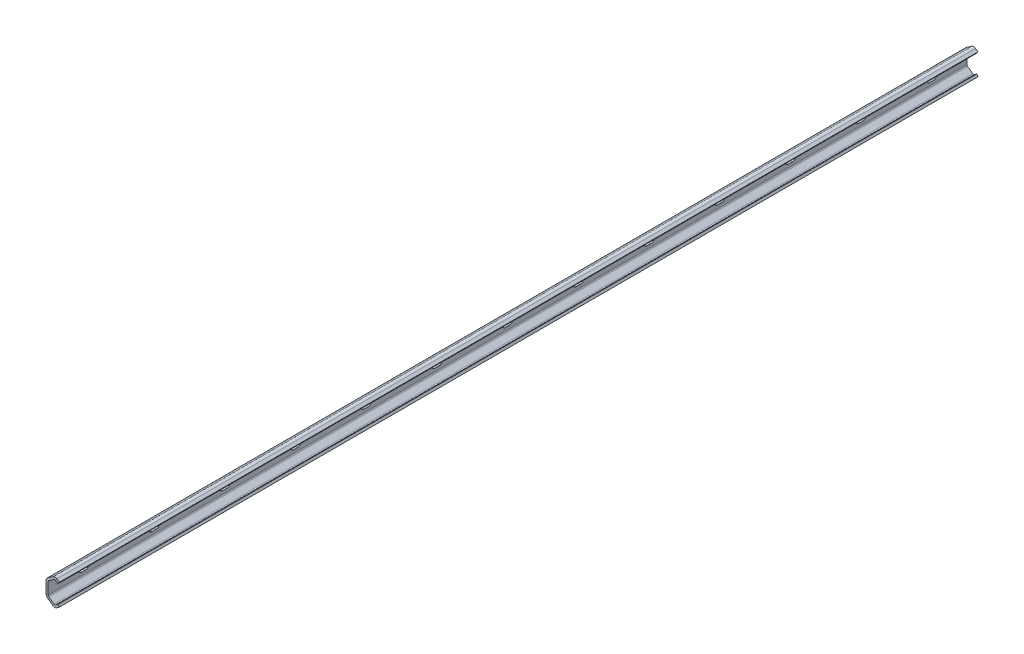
ISO-10303-21;
HEADER;
FILE_DESCRIPTION(('STEP AP214'),'2;1');
FILE_NAME('part.step','',(''),(''),'','','');
FILE_SCHEMA(('AUTOMOTIVE_DESIGN { 1 0 10303 214 1 1 1 1 }'));
ENDSEC;
DATA;
#1=APPLICATION_CONTEXT('core data for automotive mechanical design processes');
#2=APPLICATION_PROTOCOL_DEFINITION('international standard','automotive_design',2000,#1);
#3=PRODUCT_CONTEXT('',#1,'mechanical');
#4=PRODUCT('Part','Part','',(#3));
#5=PRODUCT_RELATED_PRODUCT_CATEGORY('part','',(#4));
#6=PRODUCT_DEFINITION_FORMATION('','',#4);
#7=PRODUCT_DEFINITION_CONTEXT('part definition',#1,'design');
#8=PRODUCT_DEFINITION('design','',#6,#7);
#9=PRODUCT_DEFINITION_SHAPE('','',#8);
#10=(LENGTH_UNIT() NAMED_UNIT(*) SI_UNIT(.MILLI.,.METRE.));
#11=(NAMED_UNIT(*) PLANE_ANGLE_UNIT() SI_UNIT($,.RADIAN.));
#12=(NAMED_UNIT(*) SI_UNIT($,.STERADIAN.) SOLID_ANGLE_UNIT());
#13=UNCERTAINTY_MEASURE_WITH_UNIT(LENGTH_MEASURE(1.E-05),#10,'distance_accuracy_value','');
#14=(GEOMETRIC_REPRESENTATION_CONTEXT(3) GLOBAL_UNCERTAINTY_ASSIGNED_CONTEXT((#13)) GLOBAL_UNIT_ASSIGNED_CONTEXT((#10,
#11,#12)) REPRESENTATION_CONTEXT('',''));
#15=CARTESIAN_POINT('',(0.,0.,0.));
#16=DIRECTION('',(0.,0.,1.));
#17=DIRECTION('',(1.,0.,0.));
#18=AXIS2_PLACEMENT_3D('',#15,#16,#17);
#19=CARTESIAN_POINT('',(10.8610164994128,-12.0551732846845,-1040.));
#20=DIRECTION('',(-0.573576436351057,0.819152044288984,0.));
#21=DIRECTION('',(-0.819152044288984,-0.573576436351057,0.));
#22=AXIS2_PLACEMENT_3D('',#19,#20,#21);
#23=PLANE('',#22);
#24=DIRECTION('',(-0.819152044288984,-0.573576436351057,0.));
#25=VECTOR('',#24,1.);
#26=CARTESIAN_POINT('',(10.8610164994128,-12.0551732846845,0.));
#27=LINE('',#26,#25);
#28=CARTESIAN_POINT('',(13.5660589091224,-10.1610821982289,0.));
#29=VERTEX_POINT('',#28);
#30=CARTESIAN_POINT('',(10.8610164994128,-12.0551732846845,0.));
#31=VERTEX_POINT('',#30);
#32=EDGE_CURVE('E580',#29,#31,#27,.T.);
#33=ORIENTED_EDGE('',*,*,#32,.F.);
#34=DIRECTION('',(0.,0.,1.));
#35=VECTOR('',#34,1.);
#36=CARTESIAN_POINT('',(13.5660589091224,-10.1610821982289,-1040.));
#37=LINE('',#36,#35);
#38=CARTESIAN_POINT('',(13.5660589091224,-10.1610821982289,-1040.));
#39=VERTEX_POINT('',#38);
#40=EDGE_CURVE('E749',#39,#29,#37,.T.);
#41=ORIENTED_EDGE('',*,*,#40,.F.);
#42=DIRECTION('',(-0.819152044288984,-0.573576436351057,0.));
#43=VECTOR('',#42,1.);
#44=CARTESIAN_POINT('',(10.8610164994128,-12.0551732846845,-1040.));
#45=LINE('',#44,#43);
#46=CARTESIAN_POINT('',(10.8610164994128,-12.0551732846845,-1040.));
#47=VERTEX_POINT('',#46);
#48=EDGE_CURVE('E590',#39,#47,#45,.T.);
#49=ORIENTED_EDGE('',*,*,#48,.T.);
#50=DIRECTION('',(0.,0.,1.));
#51=VECTOR('',#50,1.);
#52=CARTESIAN_POINT('',(10.8610164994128,-12.0551732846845,-1040.));
#53=LINE('',#52,#51);
#54=EDGE_CURVE('E671',#47,#31,#53,.T.);
#55=ORIENTED_EDGE('',*,*,#54,.T.);
#56=EDGE_LOOP('',(#33,#41,#49,#55));
#57=FACE_BOUND('',#56,.T.);
#58=ADVANCED_FACE('F39',(#57),#23,.T.);
#59=CARTESIAN_POINT('',(13.5660589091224,-10.1610821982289,-1040.));
#60=DIRECTION('',(0.819152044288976,0.573576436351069,0.));
#61=DIRECTION('',(-0.573576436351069,0.819152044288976,0.));
#62=AXIS2_PLACEMENT_3D('',#59,#60,#61);
#63=PLANE('',#62);
#64=DIRECTION('',(-0.573576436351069,0.819152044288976,0.));
#65=VECTOR('',#64,1.);
#66=CARTESIAN_POINT('',(13.5660589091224,-10.1610821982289,0.));
#67=LINE('',#66,#65);
#68=CARTESIAN_POINT('',(14.9999999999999,-12.2089623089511,0.));
#69=VERTEX_POINT('',#68);
#70=EDGE_CURVE('E595',#69,#29,#67,.T.);
#71=ORIENTED_EDGE('',*,*,#70,.F.);
#72=DIRECTION('',(0.,0.,1.));
#73=VECTOR('',#72,1.);
#74=CARTESIAN_POINT('',(14.9999999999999,-12.2089623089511,-1040.));
#75=LINE('',#74,#73);
#76=CARTESIAN_POINT('',(14.9999999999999,-12.2089623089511,-1040.));
#77=VERTEX_POINT('',#76);
#78=EDGE_CURVE('E753',#77,#69,#75,.T.);
#79=ORIENTED_EDGE('',*,*,#78,.F.);
#80=DIRECTION('',(-0.573576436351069,0.819152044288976,0.));
#81=VECTOR('',#80,1.);
#82=CARTESIAN_POINT('',(13.5660589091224,-10.1610821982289,-1040.));
#83=LINE('',#82,#81);
#84=EDGE_CURVE('E667',#77,#39,#83,.T.);
#85=ORIENTED_EDGE('',*,*,#84,.T.);
#86=ORIENTED_EDGE('',*,*,#40,.T.);
#87=EDGE_LOOP('',(#71,#79,#85,#86));
#88=FACE_BOUND('',#87,.T.);
#89=ADVANCED_FACE('F1300',(#88),#63,.T.);
#90=CARTESIAN_POINT('',(14.9999999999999,-12.2089623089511,-1040.));
#91=DIRECTION('',(0.573576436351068,-0.819152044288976,0.));
#92=DIRECTION('',(0.819152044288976,0.573576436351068,0.));
#93=AXIS2_PLACEMENT_3D('',#90,#91,#92);
#94=PLANE('',#93);
#95=DIRECTION('',(0.819152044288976,0.573576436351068,0.));
#96=VECTOR('',#95,1.);
#97=CARTESIAN_POINT('',(14.9999999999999,-12.2089623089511,0.));
#98=LINE('',#97,#96);
#99=CARTESIAN_POINT('',(12.158978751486,-14.1982668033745,0.));
#100=VERTEX_POINT('',#99);
#101=EDGE_CURVE('E742',#100,#69,#98,.T.);
#102=ORIENTED_EDGE('',*,*,#101,.F.);
#103=DIRECTION('',(0.,0.,1.));
#104=VECTOR('',#103,1.);
#105=CARTESIAN_POINT('',(12.158978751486,-14.1982668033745,-1040.));
#106=LINE('',#105,#104);
#107=CARTESIAN_POINT('',(12.158978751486,-14.1982668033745,-1040.));
#108=VERTEX_POINT('',#107);
#109=EDGE_CURVE('E756',#108,#100,#106,.T.);
#110=ORIENTED_EDGE('',*,*,#109,.F.);
#111=DIRECTION('',(0.819152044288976,0.573576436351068,0.));
#112=VECTOR('',#111,1.);
#113=CARTESIAN_POINT('',(14.9999999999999,-12.2089623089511,-1040.));
#114=LINE('',#113,#112);
#115=EDGE_CURVE('E663',#108,#77,#114,.T.);
#116=ORIENTED_EDGE('',*,*,#115,.T.);
#117=ORIENTED_EDGE('',*,*,#78,.T.);
#118=EDGE_LOOP('',(#102,#110,#116,#117));
#119=FACE_BOUND('',#118,.T.);
#120=ADVANCED_FACE('F1306',(#119),#94,.T.);
#121=CARTESIAN_POINT('',(9.99999999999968,-11.1149256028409,-1040.));
#122=DIRECTION('',(0.,0.,1.));
#123=DIRECTION('',(1.,0.,0.));
#124=AXIS2_PLACEMENT_3D('',#121,#122,#123);
#125=CYLINDRICAL_SURFACE('',#124,3.76406458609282);
#126=CARTESIAN_POINT('',(9.99999999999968,-11.1149256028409,0.));
#127=DIRECTION('',(0.,0.,1.));
#128=DIRECTION('',(-1.,0.,0.));
#129=AXIS2_PLACEMENT_3D('',#126,#127,#128);
#130=CIRCLE('',#129,3.76406458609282);
#131=CARTESIAN_POINT('',(7.84102124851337,-14.1982668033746,0.));
#132=VERTEX_POINT('',#131);
#133=EDGE_CURVE('E738',#132,#100,#130,.T.);
#134=ORIENTED_EDGE('',*,*,#133,.F.);
#135=DIRECTION('',(0.,0.,1.));
#136=VECTOR('',#135,1.);
#137=CARTESIAN_POINT('',(7.84102124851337,-14.1982668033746,-1040.));
#138=LINE('',#137,#136);
#139=CARTESIAN_POINT('',(7.84102124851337,-14.1982668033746,-1040.));
#140=VERTEX_POINT('',#139);
#141=EDGE_CURVE('E759',#140,#132,#138,.T.);
#142=ORIENTED_EDGE('',*,*,#141,.F.);
#143=CARTESIAN_POINT('',(9.99999999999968,-11.1149256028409,-1040.));
#144=DIRECTION('',(0.,0.,1.));
#145=DIRECTION('',(-1.,0.,0.));
#146=AXIS2_PLACEMENT_3D('',#143,#144,#145);
#147=CIRCLE('',#146,3.76406458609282);
#148=EDGE_CURVE('E659',#140,#108,#147,.T.);
#149=ORIENTED_EDGE('',*,*,#148,.T.);
#150=ORIENTED_EDGE('',*,*,#109,.T.);
#151=EDGE_LOOP('',(#134,#142,#149,#150));
#152=FACE_BOUND('',#151,.T.);
#153=ADVANCED_FACE('F1525',(#152),#125,.T.);
#154=CARTESIAN_POINT('',(7.84102124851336,-14.1982668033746,-1040.));
#155=DIRECTION('',(-0.573576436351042,-0.819152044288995,0.));
#156=DIRECTION('',(0.819152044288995,-0.573576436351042,0.));
#157=AXIS2_PLACEMENT_3D('',#154,#155,#156);
#158=PLANE('',#157);
#159=DIRECTION('',(0.819152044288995,-0.573576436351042,0.));
#160=VECTOR('',#159,1.);
#161=CARTESIAN_POINT('',(7.84102124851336,-14.1982668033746,0.));
#162=LINE('',#161,#160);
#163=CARTESIAN_POINT('',(2.07234263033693,-10.1589945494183,0.));
#164=VERTEX_POINT('',#163);
#165=EDGE_CURVE('E734',#164,#132,#162,.T.);
#166=ORIENTED_EDGE('',*,*,#165,.F.);
#167=DIRECTION('',(0.,0.,1.));
#168=VECTOR('',#167,1.);
#169=CARTESIAN_POINT('',(2.07234263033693,-10.1589945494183,-1040.));
#170=LINE('',#169,#168);
#171=CARTESIAN_POINT('',(2.07234263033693,-10.1589945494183,-1040.));
#172=VERTEX_POINT('',#171);
#173=EDGE_CURVE('E762',#172,#164,#170,.T.);
#174=ORIENTED_EDGE('',*,*,#173,.F.);
#175=DIRECTION('',(0.819152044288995,-0.573576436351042,0.));
#176=VECTOR('',#175,1.);
#177=CARTESIAN_POINT('',(7.84102124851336,-14.1982668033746,-1040.));
#178=LINE('',#177,#176);
#179=EDGE_CURVE('E655',#172,#140,#178,.T.);
#180=ORIENTED_EDGE('',*,*,#179,.T.);
#181=ORIENTED_EDGE('',*,*,#141,.T.);
#182=EDGE_LOOP('',(#166,#174,#180,#181));
#183=FACE_BOUND('',#182,.T.);
#184=ADVANCED_FACE('F1529',(#183),#158,.T.);
#185=CARTESIAN_POINT('',(4.86533888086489,-6.17018252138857,-1040.));
#186=DIRECTION('',(0.,0.,1.));
#187=DIRECTION('',(1.,0.,0.));
#188=AXIS2_PLACEMENT_3D('',#185,#186,#187);
#189=CYLINDRICAL_SURFACE('',#188,4.86944036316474);
#190=CARTESIAN_POINT('',(4.86533888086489,-6.17018252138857,0.));
#191=DIRECTION('',(0.,0.,1.));
#192=DIRECTION('',(-1.,0.,0.));
#193=AXIS2_PLACEMENT_3D('',#190,#191,#192);
#194=CIRCLE('',#193,4.86944036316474);
#195=CARTESIAN_POINT('',(-3.85108611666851E-13,-6.36999999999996,0.));
#196=VERTEX_POINT('',#195);
#197=EDGE_CURVE('E730',#196,#164,#194,.T.);
#198=ORIENTED_EDGE('',*,*,#197,.F.);
#199=DIRECTION('',(0.,0.,1.));
#200=VECTOR('',#199,1.);
#201=CARTESIAN_POINT('',(-3.85108611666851E-13,-6.36999999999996,-1040.));
#202=LINE('',#201,#200);
#203=CARTESIAN_POINT('',(-3.85108611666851E-13,-6.36999999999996,-1040.));
#204=VERTEX_POINT('',#203);
#205=EDGE_CURVE('E765',#204,#196,#202,.T.);
#206=ORIENTED_EDGE('',*,*,#205,.F.);
#207=CARTESIAN_POINT('',(4.86533888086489,-6.17018252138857,-1040.));
#208=DIRECTION('',(0.,0.,1.));
#209=DIRECTION('',(-1.,0.,0.));
#210=AXIS2_PLACEMENT_3D('',#207,#208,#209);
#211=CIRCLE('',#210,4.86944036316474);
#212=EDGE_CURVE('E651',#204,#172,#211,.T.);
#213=ORIENTED_EDGE('',*,*,#212,.T.);
#214=ORIENTED_EDGE('',*,*,#173,.T.);
#215=EDGE_LOOP('',(#198,#206,#213,#214));
#216=FACE_BOUND('',#215,.T.);
#217=ADVANCED_FACE('F1534',(#216),#189,.T.);
#218=CARTESIAN_POINT('',(-3.75848512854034E-13,-6.36999999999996,-1040.));
#219=DIRECTION('',(-1.,0.,0.));
#220=DIRECTION('',(0.,-1.,0.));
#221=AXIS2_PLACEMENT_3D('',#218,#219,#220);
#222=PLANE('',#221);
#223=CARTESIAN_POINT('',(-3.87277016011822E-13,0.,-117.5));
#224=DIRECTION('',(1.,0.,0.));
#225=DIRECTION('',(0.,1.,0.));
#226=AXIS2_PLACEMENT_3D('',#223,#224,#225);
#227=CIRCLE('',#226,3.);
#228=CARTESIAN_POINT('',(-3.87710696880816E-13,3.,-117.5));
#229=VERTEX_POINT('',#228);
#230=CARTESIAN_POINT('',(-3.86843335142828E-13,-3.,-117.5));
#231=VERTEX_POINT('',#230);
#232=EDGE_CURVE('E541',#229,#231,#227,.T.);
#233=ORIENTED_EDGE('',*,*,#232,.T.);
#234=DIRECTION('',(0.,0.,-1.));
#235=VECTOR('',#234,1.);
#236=CARTESIAN_POINT('',(-3.86843335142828E-13,-3.,-117.5));
#237=LINE('',#236,#235);
#238=CARTESIAN_POINT('',(-3.76233085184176E-13,-3.,-122.5));
#239=VERTEX_POINT('',#238);
#240=EDGE_CURVE('E502',#231,#239,#237,.T.);
#241=ORIENTED_EDGE('',*,*,#240,.T.);
#242=CARTESIAN_POINT('',(-3.87277016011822E-13,0.,-122.5));
#243=DIRECTION('',(1.,0.,0.));
#244=DIRECTION('',(0.,-1.,0.));
#245=AXIS2_PLACEMENT_3D('',#242,#243,#244);
#246=CIRCLE('',#245,3.);
#247=CARTESIAN_POINT('',(-3.87710696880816E-13,3.,-122.5));
#248=VERTEX_POINT('',#247);
#249=EDGE_CURVE('E509',#239,#248,#246,.T.);
#250=ORIENTED_EDGE('',*,*,#249,.T.);
#251=DIRECTION('',(0.,0.,1.));
#252=VECTOR('',#251,1.);
#253=CARTESIAN_POINT('',(-3.87710696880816E-13,3.,-117.5));
#254=LINE('',#253,#252);
#255=EDGE_CURVE('E534',#248,#229,#254,.T.);
#256=ORIENTED_EDGE('',*,*,#255,.T.);
#257=EDGE_LOOP('',(#233,#241,#250,#256));
#258=FACE_BOUND('',#257,.T.);
#259=CARTESIAN_POINT('',(-3.87277016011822E-13,0.,-37.5));
#260=DIRECTION('',(1.,0.,0.));
#261=DIRECTION('',(0.,1.,0.));
#262=AXIS2_PLACEMENT_3D('',#259,#260,#261);
#263=CIRCLE('',#262,3.);
#264=CARTESIAN_POINT('',(-3.87710696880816E-13,3.,-37.5));
#265=VERTEX_POINT('',#264);
#266=CARTESIAN_POINT('',(-3.86843335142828E-13,-3.,-37.5));
#267=VERTEX_POINT('',#266);
#268=EDGE_CURVE('E546',#265,#267,#263,.T.);
#269=ORIENTED_EDGE('',*,*,#268,.T.);
#270=DIRECTION('',(0.,0.,-1.));
#271=VECTOR('',#270,1.);
#272=CARTESIAN_POINT('',(-3.86843335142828E-13,-3.,-37.5));
#273=LINE('',#272,#271);
#274=CARTESIAN_POINT('',(-3.76233085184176E-13,-3.,-42.5));
#275=VERTEX_POINT('',#274);
#276=EDGE_CURVE('E550',#267,#275,#273,.T.);
#277=ORIENTED_EDGE('',*,*,#276,.T.);
#278=CARTESIAN_POINT('',(-3.87277016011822E-13,0.,-42.5));
#279=DIRECTION('',(1.,0.,0.));
#280=DIRECTION('',(0.,-1.,0.));
#281=AXIS2_PLACEMENT_3D('',#278,#279,#280);
#282=CIRCLE('',#281,3.);
#283=CARTESIAN_POINT('',(-3.87710696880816E-13,3.,-42.5));
#284=VERTEX_POINT('',#283);
#285=EDGE_CURVE('E555',#275,#284,#282,.T.);
#286=ORIENTED_EDGE('',*,*,#285,.T.);
#287=DIRECTION('',(0.,0.,1.));
#288=VECTOR('',#287,1.);
#289=CARTESIAN_POINT('',(-3.87710696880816E-13,3.,-37.5));
#290=LINE('',#289,#288);
#291=EDGE_CURVE('E559',#284,#265,#290,.T.);
#292=ORIENTED_EDGE('',*,*,#291,.T.);
#293=EDGE_LOOP('',(#269,#277,#286,#292));
#294=FACE_BOUND('',#293,.T.);
#295=DIRECTION('',(0.,-1.,0.));
#296=VECTOR('',#295,1.);
#297=CARTESIAN_POINT('',(-3.75848512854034E-13,-6.36999999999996,0.));
#298=LINE('',#297,#296);
#299=CARTESIAN_POINT('',(-3.77302356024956E-13,6.36999999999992,0.));
#300=VERTEX_POINT('',#299);
#301=EDGE_CURVE('E726',#300,#196,#298,.T.);
#302=ORIENTED_EDGE('',*,*,#301,.F.);
#303=DIRECTION('',(0.,0.,1.));
#304=VECTOR('',#303,1.);
#305=CARTESIAN_POINT('',(-3.77302356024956E-13,6.36999999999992,-1040.));
#306=LINE('',#305,#304);
#307=CARTESIAN_POINT('',(-3.77302356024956E-13,6.36999999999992,-1040.));
#308=VERTEX_POINT('',#307);
#309=EDGE_CURVE('E768',#308,#300,#306,.T.);
#310=ORIENTED_EDGE('',*,*,#309,.F.);
#311=DIRECTION('',(0.,-1.,0.));
#312=VECTOR('',#311,1.);
#313=CARTESIAN_POINT('',(-3.75848512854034E-13,-6.36999999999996,-1040.));
#314=LINE('',#313,#312);
#315=EDGE_CURVE('E647',#308,#204,#314,.T.);
#316=ORIENTED_EDGE('',*,*,#315,.T.);
#317=ORIENTED_EDGE('',*,*,#205,.T.);
#318=EDGE_LOOP('',(#302,#310,#316,#317));
#319=FACE_BOUND('',#318,.T.);
#320=CARTESIAN_POINT('',(-3.87277016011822E-13,0.,-197.5));
#321=DIRECTION('',(1.,0.,0.));
#322=DIRECTION('',(0.,1.,0.));
#323=AXIS2_PLACEMENT_3D('',#320,#321,#322);
#324=CIRCLE('',#323,3.);
#325=CARTESIAN_POINT('',(-3.87710696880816E-13,3.,-197.5));
#326=VERTEX_POINT('',#325);
#327=CARTESIAN_POINT('',(-3.86843335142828E-13,-3.,-197.5));
#328=VERTEX_POINT('',#327);
#329=EDGE_CURVE('E823',#326,#328,#324,.T.);
#330=ORIENTED_EDGE('',*,*,#329,.T.);
#331=DIRECTION('',(0.,0.,-1.));
#332=VECTOR('',#331,1.);
#333=CARTESIAN_POINT('',(-3.86843335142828E-13,-3.,-197.5));
#334=LINE('',#333,#332);
#335=CARTESIAN_POINT('',(-3.76233085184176E-13,-3.,-202.5));
#336=VERTEX_POINT('',#335);
#337=EDGE_CURVE('E826',#328,#336,#334,.T.);
#338=ORIENTED_EDGE('',*,*,#337,.T.);
#339=CARTESIAN_POINT('',(-3.87277016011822E-13,0.,-202.5));
#340=DIRECTION('',(1.,0.,0.));
#341=DIRECTION('',(0.,-1.,0.));
#342=AXIS2_PLACEMENT_3D('',#339,#340,#341);
#343=CIRCLE('',#342,3.);
#344=CARTESIAN_POINT('',(-3.87710696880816E-13,3.,-202.5));
#345=VERTEX_POINT('',#344);
#346=EDGE_CURVE('E829',#336,#345,#343,.T.);
#347=ORIENTED_EDGE('',*,*,#346,.T.);
#348=DIRECTION('',(0.,0.,1.));
#349=VECTOR('',#348,1.);
#350=CARTESIAN_POINT('',(-3.87710696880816E-13,3.,-197.5));
#351=LINE('',#350,#349);
#352=EDGE_CURVE('E832',#345,#326,#351,.T.);
#353=ORIENTED_EDGE('',*,*,#352,.T.);
#354=EDGE_LOOP('',(#330,#338,#347,#353));
#355=FACE_BOUND('',#354,.T.);
#356=CARTESIAN_POINT('',(-3.87277016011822E-13,0.,-277.5));
#357=DIRECTION('',(1.,0.,0.));
#358=DIRECTION('',(0.,1.,0.));
#359=AXIS2_PLACEMENT_3D('',#356,#357,#358);
#360=CIRCLE('',#359,3.);
#361=CARTESIAN_POINT('',(-3.87710696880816E-13,3.,-277.5));
#362=VERTEX_POINT('',#361);
#363=CARTESIAN_POINT('',(-3.86843335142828E-13,-3.,-277.5));
#364=VERTEX_POINT('',#363);
#365=EDGE_CURVE('E867',#362,#364,#360,.T.);
#366=ORIENTED_EDGE('',*,*,#365,.T.);
#367=DIRECTION('',(0.,0.,-1.));
#368=VECTOR('',#367,1.);
#369=CARTESIAN_POINT('',(-3.86843335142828E-13,-3.,-277.5));
#370=LINE('',#369,#368);
#371=CARTESIAN_POINT('',(-3.76233085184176E-13,-3.,-282.5));
#372=VERTEX_POINT('',#371);
#373=EDGE_CURVE('E870',#364,#372,#370,.T.);
#374=ORIENTED_EDGE('',*,*,#373,.T.);
#375=CARTESIAN_POINT('',(-3.87277016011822E-13,0.,-282.5));
#376=DIRECTION('',(1.,0.,0.));
#377=DIRECTION('',(0.,-1.,0.));
#378=AXIS2_PLACEMENT_3D('',#375,#376,#377);
#379=CIRCLE('',#378,3.);
#380=CARTESIAN_POINT('',(-3.87710696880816E-13,3.,-282.5));
#381=VERTEX_POINT('',#380);
#382=EDGE_CURVE('E873',#372,#381,#379,.T.);
#383=ORIENTED_EDGE('',*,*,#382,.T.);
#384=DIRECTION('',(0.,0.,1.));
#385=VECTOR('',#384,1.);
#386=CARTESIAN_POINT('',(-3.87710696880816E-13,3.,-277.5));
#387=LINE('',#386,#385);
#388=EDGE_CURVE('E876',#381,#362,#387,.T.);
#389=ORIENTED_EDGE('',*,*,#388,.T.);
#390=EDGE_LOOP('',(#366,#374,#383,#389));
#391=FACE_BOUND('',#390,.T.);
#392=CARTESIAN_POINT('',(-3.87277016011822E-13,0.,-357.5));
#393=DIRECTION('',(1.,0.,0.));
#394=DIRECTION('',(0.,1.,0.));
#395=AXIS2_PLACEMENT_3D('',#392,#393,#394);
#396=CIRCLE('',#395,3.);
#397=CARTESIAN_POINT('',(-3.87710696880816E-13,3.,-357.5));
#398=VERTEX_POINT('',#397);
#399=CARTESIAN_POINT('',(-3.86843335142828E-13,-3.,-357.5));
#400=VERTEX_POINT('',#399);
#401=EDGE_CURVE('E911',#398,#400,#396,.T.);
#402=ORIENTED_EDGE('',*,*,#401,.T.);
#403=DIRECTION('',(0.,0.,-1.));
#404=VECTOR('',#403,1.);
#405=CARTESIAN_POINT('',(-3.86843335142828E-13,-3.,-357.5));
#406=LINE('',#405,#404);
#407=CARTESIAN_POINT('',(-3.76233085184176E-13,-3.,-362.5));
#408=VERTEX_POINT('',#407);
#409=EDGE_CURVE('E914',#400,#408,#406,.T.);
#410=ORIENTED_EDGE('',*,*,#409,.T.);
#411=CARTESIAN_POINT('',(-3.87277016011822E-13,0.,-362.5));
#412=DIRECTION('',(1.,0.,0.));
#413=DIRECTION('',(0.,-1.,0.));
#414=AXIS2_PLACEMENT_3D('',#411,#412,#413);
#415=CIRCLE('',#414,3.);
#416=CARTESIAN_POINT('',(-3.87710696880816E-13,3.,-362.5));
#417=VERTEX_POINT('',#416);
#418=EDGE_CURVE('E917',#408,#417,#415,.T.);
#419=ORIENTED_EDGE('',*,*,#418,.T.);
#420=DIRECTION('',(0.,0.,1.));
#421=VECTOR('',#420,1.);
#422=CARTESIAN_POINT('',(-3.87710696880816E-13,3.,-357.5));
#423=LINE('',#422,#421);
#424=EDGE_CURVE('E920',#417,#398,#423,.T.);
#425=ORIENTED_EDGE('',*,*,#424,.T.);
#426=EDGE_LOOP('',(#402,#410,#419,#425));
#427=FACE_BOUND('',#426,.T.);
#428=CARTESIAN_POINT('',(-3.87277016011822E-13,0.,-437.5));
#429=DIRECTION('',(1.,0.,0.));
#430=DIRECTION('',(0.,1.,0.));
#431=AXIS2_PLACEMENT_3D('',#428,#429,#430);
#432=CIRCLE('',#431,3.);
#433=CARTESIAN_POINT('',(-3.87710696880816E-13,3.,-437.5));
#434=VERTEX_POINT('',#433);
#435=CARTESIAN_POINT('',(-3.86843335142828E-13,-3.,-437.5));
#436=VERTEX_POINT('',#435);
#437=EDGE_CURVE('E955',#434,#436,#432,.T.);
#438=ORIENTED_EDGE('',*,*,#437,.T.);
#439=DIRECTION('',(0.,0.,-1.));
#440=VECTOR('',#439,1.);
#441=CARTESIAN_POINT('',(-3.86843335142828E-13,-3.,-437.5));
#442=LINE('',#441,#440);
#443=CARTESIAN_POINT('',(-3.76233085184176E-13,-3.,-442.5));
#444=VERTEX_POINT('',#443);
#445=EDGE_CURVE('E958',#436,#444,#442,.T.);
#446=ORIENTED_EDGE('',*,*,#445,.T.);
#447=CARTESIAN_POINT('',(-3.87277016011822E-13,0.,-442.5));
#448=DIRECTION('',(1.,0.,0.));
#449=DIRECTION('',(0.,-1.,0.));
#450=AXIS2_PLACEMENT_3D('',#447,#448,#449);
#451=CIRCLE('',#450,3.);
#452=CARTESIAN_POINT('',(-3.87710696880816E-13,3.,-442.5));
#453=VERTEX_POINT('',#452);
#454=EDGE_CURVE('E961',#444,#453,#451,.T.);
#455=ORIENTED_EDGE('',*,*,#454,.T.);
#456=DIRECTION('',(0.,0.,1.));
#457=VECTOR('',#456,1.);
#458=CARTESIAN_POINT('',(-3.87710696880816E-13,3.,-437.5));
#459=LINE('',#458,#457);
#460=EDGE_CURVE('E964',#453,#434,#459,.T.);
#461=ORIENTED_EDGE('',*,*,#460,.T.);
#462=EDGE_LOOP('',(#438,#446,#455,#461));
#463=FACE_BOUND('',#462,.T.);
#464=CARTESIAN_POINT('',(-3.87277016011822E-13,0.,-517.5));
#465=DIRECTION('',(1.,0.,0.));
#466=DIRECTION('',(0.,1.,0.));
#467=AXIS2_PLACEMENT_3D('',#464,#465,#466);
#468=CIRCLE('',#467,3.);
#469=CARTESIAN_POINT('',(-3.87710696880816E-13,3.,-517.5));
#470=VERTEX_POINT('',#469);
#471=CARTESIAN_POINT('',(-3.86843335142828E-13,-3.,-517.5));
#472=VERTEX_POINT('',#471);
#473=EDGE_CURVE('E999',#470,#472,#468,.T.);
#474=ORIENTED_EDGE('',*,*,#473,.T.);
#475=DIRECTION('',(0.,0.,-1.));
#476=VECTOR('',#475,1.);
#477=CARTESIAN_POINT('',(-3.86843335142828E-13,-3.,-517.5));
#478=LINE('',#477,#476);
#479=CARTESIAN_POINT('',(-3.76233085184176E-13,-3.,-522.5));
#480=VERTEX_POINT('',#479);
#481=EDGE_CURVE('E1002',#472,#480,#478,.T.);
#482=ORIENTED_EDGE('',*,*,#481,.T.);
#483=CARTESIAN_POINT('',(-3.87277016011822E-13,0.,-522.5));
#484=DIRECTION('',(1.,0.,0.));
#485=DIRECTION('',(0.,-1.,0.));
#486=AXIS2_PLACEMENT_3D('',#483,#484,#485);
#487=CIRCLE('',#486,3.);
#488=CARTESIAN_POINT('',(-3.87710696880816E-13,3.,-522.5));
#489=VERTEX_POINT('',#488);
#490=EDGE_CURVE('E1005',#480,#489,#487,.T.);
#491=ORIENTED_EDGE('',*,*,#490,.T.);
#492=DIRECTION('',(0.,0.,1.));
#493=VECTOR('',#492,1.);
#494=CARTESIAN_POINT('',(-3.87710696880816E-13,3.,-517.5));
#495=LINE('',#494,#493);
#496=EDGE_CURVE('E1008',#489,#470,#495,.T.);
#497=ORIENTED_EDGE('',*,*,#496,.T.);
#498=EDGE_LOOP('',(#474,#482,#491,#497));
#499=FACE_BOUND('',#498,.T.);
#500=CARTESIAN_POINT('',(-3.87277016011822E-13,0.,-597.5));
#501=DIRECTION('',(1.,0.,0.));
#502=DIRECTION('',(0.,1.,0.));
#503=AXIS2_PLACEMENT_3D('',#500,#501,#502);
#504=CIRCLE('',#503,3.);
#505=CARTESIAN_POINT('',(-3.87710696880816E-13,3.,-597.5));
#506=VERTEX_POINT('',#505);
#507=CARTESIAN_POINT('',(-3.86843335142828E-13,-3.,-597.5));
#508=VERTEX_POINT('',#507);
#509=EDGE_CURVE('E1042',#506,#508,#504,.T.);
#510=ORIENTED_EDGE('',*,*,#509,.T.);
#511=DIRECTION('',(0.,0.,-1.));
#512=VECTOR('',#511,1.);
#513=CARTESIAN_POINT('',(-3.86843335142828E-13,-3.,-597.5));
#514=LINE('',#513,#512);
#515=CARTESIAN_POINT('',(-3.76233085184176E-13,-3.,-602.5));
#516=VERTEX_POINT('',#515);
#517=EDGE_CURVE('E1045',#508,#516,#514,.T.);
#518=ORIENTED_EDGE('',*,*,#517,.T.);
#519=CARTESIAN_POINT('',(-3.87277016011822E-13,0.,-602.5));
#520=DIRECTION('',(1.,0.,0.));
#521=DIRECTION('',(0.,-1.,0.));
#522=AXIS2_PLACEMENT_3D('',#519,#520,#521);
#523=CIRCLE('',#522,3.);
#524=CARTESIAN_POINT('',(-3.87710696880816E-13,3.,-602.5));
#525=VERTEX_POINT('',#524);
#526=EDGE_CURVE('E1048',#516,#525,#523,.T.);
#527=ORIENTED_EDGE('',*,*,#526,.T.);
#528=DIRECTION('',(0.,0.,1.));
#529=VECTOR('',#528,1.);
#530=CARTESIAN_POINT('',(-3.87710696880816E-13,3.,-597.5));
#531=LINE('',#530,#529);
#532=EDGE_CURVE('E1051',#525,#506,#531,.T.);
#533=ORIENTED_EDGE('',*,*,#532,.T.);
#534=EDGE_LOOP('',(#510,#518,#527,#533));
#535=FACE_BOUND('',#534,.T.);
#536=CARTESIAN_POINT('',(-3.87277016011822E-13,0.,-677.5));
#537=DIRECTION('',(1.,0.,0.));
#538=DIRECTION('',(0.,1.,0.));
#539=AXIS2_PLACEMENT_3D('',#536,#537,#538);
#540=CIRCLE('',#539,3.);
#541=CARTESIAN_POINT('',(-3.87710696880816E-13,3.,-677.5));
#542=VERTEX_POINT('',#541);
#543=CARTESIAN_POINT('',(-3.86843335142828E-13,-3.,-677.5));
#544=VERTEX_POINT('',#543);
#545=EDGE_CURVE('E1086',#542,#544,#540,.T.);
#546=ORIENTED_EDGE('',*,*,#545,.T.);
#547=DIRECTION('',(0.,0.,-1.));
#548=VECTOR('',#547,1.);
#549=CARTESIAN_POINT('',(-3.86843335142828E-13,-3.,-677.5));
#550=LINE('',#549,#548);
#551=CARTESIAN_POINT('',(-3.76233085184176E-13,-3.,-682.5));
#552=VERTEX_POINT('',#551);
#553=EDGE_CURVE('E1089',#544,#552,#550,.T.);
#554=ORIENTED_EDGE('',*,*,#553,.T.);
#555=CARTESIAN_POINT('',(-3.87277016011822E-13,0.,-682.5));
#556=DIRECTION('',(1.,0.,0.));
#557=DIRECTION('',(0.,-1.,0.));
#558=AXIS2_PLACEMENT_3D('',#555,#556,#557);
#559=CIRCLE('',#558,3.);
#560=CARTESIAN_POINT('',(-3.87710696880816E-13,3.,-682.5));
#561=VERTEX_POINT('',#560);
#562=EDGE_CURVE('E1092',#552,#561,#559,.T.);
#563=ORIENTED_EDGE('',*,*,#562,.T.);
#564=DIRECTION('',(0.,0.,1.));
#565=VECTOR('',#564,1.);
#566=CARTESIAN_POINT('',(-3.87710696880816E-13,3.,-677.5));
#567=LINE('',#566,#565);
#568=EDGE_CURVE('E1095',#561,#542,#567,.T.);
#569=ORIENTED_EDGE('',*,*,#568,.T.);
#570=EDGE_LOOP('',(#546,#554,#563,#569));
#571=FACE_BOUND('',#570,.T.);
#572=CARTESIAN_POINT('',(-3.87277016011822E-13,0.,-757.5));
#573=DIRECTION('',(1.,0.,0.));
#574=DIRECTION('',(0.,1.,0.));
#575=AXIS2_PLACEMENT_3D('',#572,#573,#574);
#576=CIRCLE('',#575,3.);
#577=CARTESIAN_POINT('',(-3.87710696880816E-13,3.,-757.5));
#578=VERTEX_POINT('',#577);
#579=CARTESIAN_POINT('',(-3.86843335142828E-13,-3.,-757.5));
#580=VERTEX_POINT('',#579);
#581=EDGE_CURVE('E1130',#578,#580,#576,.T.);
#582=ORIENTED_EDGE('',*,*,#581,.T.);
#583=DIRECTION('',(0.,0.,-1.));
#584=VECTOR('',#583,1.);
#585=CARTESIAN_POINT('',(-3.86843335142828E-13,-3.,-757.5));
#586=LINE('',#585,#584);
#587=CARTESIAN_POINT('',(-3.76233085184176E-13,-3.,-762.5));
#588=VERTEX_POINT('',#587);
#589=EDGE_CURVE('E1133',#580,#588,#586,.T.);
#590=ORIENTED_EDGE('',*,*,#589,.T.);
#591=CARTESIAN_POINT('',(-3.87277016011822E-13,0.,-762.5));
#592=DIRECTION('',(1.,0.,0.));
#593=DIRECTION('',(0.,-1.,0.));
#594=AXIS2_PLACEMENT_3D('',#591,#592,#593);
#595=CIRCLE('',#594,3.);
#596=CARTESIAN_POINT('',(-3.87710696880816E-13,3.,-762.5));
#597=VERTEX_POINT('',#596);
#598=EDGE_CURVE('E1136',#588,#597,#595,.T.);
#599=ORIENTED_EDGE('',*,*,#598,.T.);
#600=DIRECTION('',(0.,0.,1.));
#601=VECTOR('',#600,1.);
#602=CARTESIAN_POINT('',(-3.87710696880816E-13,3.,-757.5));
#603=LINE('',#602,#601);
#604=EDGE_CURVE('E1139',#597,#578,#603,.T.);
#605=ORIENTED_EDGE('',*,*,#604,.T.);
#606=EDGE_LOOP('',(#582,#590,#599,#605));
#607=FACE_BOUND('',#606,.T.);
#608=CARTESIAN_POINT('',(-3.87277016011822E-13,0.,-837.5));
#609=DIRECTION('',(1.,0.,0.));
#610=DIRECTION('',(0.,1.,0.));
#611=AXIS2_PLACEMENT_3D('',#608,#609,#610);
#612=CIRCLE('',#611,3.);
#613=CARTESIAN_POINT('',(-3.87710696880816E-13,3.,-837.5));
#614=VERTEX_POINT('',#613);
#615=CARTESIAN_POINT('',(-3.86843335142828E-13,-3.,-837.5));
#616=VERTEX_POINT('',#615);
#617=EDGE_CURVE('E1174',#614,#616,#612,.T.);
#618=ORIENTED_EDGE('',*,*,#617,.T.);
#619=DIRECTION('',(0.,0.,-1.));
#620=VECTOR('',#619,1.);
#621=CARTESIAN_POINT('',(-3.86843335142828E-13,-3.,-837.5));
#622=LINE('',#621,#620);
#623=CARTESIAN_POINT('',(-3.76233085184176E-13,-3.,-842.5));
#624=VERTEX_POINT('',#623);
#625=EDGE_CURVE('E1177',#616,#624,#622,.T.);
#626=ORIENTED_EDGE('',*,*,#625,.T.);
#627=CARTESIAN_POINT('',(-3.87277016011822E-13,0.,-842.5));
#628=DIRECTION('',(1.,0.,0.));
#629=DIRECTION('',(0.,-1.,0.));
#630=AXIS2_PLACEMENT_3D('',#627,#628,#629);
#631=CIRCLE('',#630,3.);
#632=CARTESIAN_POINT('',(-3.87710696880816E-13,3.,-842.5));
#633=VERTEX_POINT('',#632);
#634=EDGE_CURVE('E1180',#624,#633,#631,.T.);
#635=ORIENTED_EDGE('',*,*,#634,.T.);
#636=DIRECTION('',(0.,0.,1.));
#637=VECTOR('',#636,1.);
#638=CARTESIAN_POINT('',(-3.87710696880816E-13,3.,-837.5));
#639=LINE('',#638,#637);
#640=EDGE_CURVE('E1183',#633,#614,#639,.T.);
#641=ORIENTED_EDGE('',*,*,#640,.T.);
#642=EDGE_LOOP('',(#618,#626,#635,#641));
#643=FACE_BOUND('',#642,.T.);
#644=CARTESIAN_POINT('',(-3.87277016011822E-13,0.,-917.5));
#645=DIRECTION('',(1.,0.,0.));
#646=DIRECTION('',(0.,1.,0.));
#647=AXIS2_PLACEMENT_3D('',#644,#645,#646);
#648=CIRCLE('',#647,3.);
#649=CARTESIAN_POINT('',(-3.87710696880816E-13,3.,-917.5));
#650=VERTEX_POINT('',#649);
#651=CARTESIAN_POINT('',(-3.86843335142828E-13,-3.,-917.5));
#652=VERTEX_POINT('',#651);
#653=EDGE_CURVE('E1218',#650,#652,#648,.T.);
#654=ORIENTED_EDGE('',*,*,#653,.T.);
#655=DIRECTION('',(0.,0.,-1.));
#656=VECTOR('',#655,1.);
#657=CARTESIAN_POINT('',(-3.86843335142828E-13,-3.,-917.5));
#658=LINE('',#657,#656);
#659=CARTESIAN_POINT('',(-3.76233085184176E-13,-3.,-922.5));
#660=VERTEX_POINT('',#659);
#661=EDGE_CURVE('E1221',#652,#660,#658,.T.);
#662=ORIENTED_EDGE('',*,*,#661,.T.);
#663=CARTESIAN_POINT('',(-3.87277016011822E-13,0.,-922.5));
#664=DIRECTION('',(1.,0.,0.));
#665=DIRECTION('',(0.,-1.,0.));
#666=AXIS2_PLACEMENT_3D('',#663,#664,#665);
#667=CIRCLE('',#666,3.);
#668=CARTESIAN_POINT('',(-3.87710696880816E-13,3.,-922.5));
#669=VERTEX_POINT('',#668);
#670=EDGE_CURVE('E1224',#660,#669,#667,.T.);
#671=ORIENTED_EDGE('',*,*,#670,.T.);
#672=DIRECTION('',(0.,0.,1.));
#673=VECTOR('',#672,1.);
#674=CARTESIAN_POINT('',(-3.87710696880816E-13,3.,-917.5));
#675=LINE('',#674,#673);
#676=EDGE_CURVE('E1227',#669,#650,#675,.T.);
#677=ORIENTED_EDGE('',*,*,#676,.T.);
#678=EDGE_LOOP('',(#654,#662,#671,#677));
#679=FACE_BOUND('',#678,.T.);
#680=CARTESIAN_POINT('',(-3.87277016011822E-13,0.,-997.5));
#681=DIRECTION('',(1.,0.,0.));
#682=DIRECTION('',(0.,1.,0.));
#683=AXIS2_PLACEMENT_3D('',#680,#681,#682);
#684=CIRCLE('',#683,3.);
#685=CARTESIAN_POINT('',(-3.87710696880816E-13,3.,-997.5));
#686=VERTEX_POINT('',#685);
#687=CARTESIAN_POINT('',(-3.86843335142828E-13,-3.,-997.5));
#688=VERTEX_POINT('',#687);
#689=EDGE_CURVE('E55',#686,#688,#684,.T.);
#690=ORIENTED_EDGE('',*,*,#689,.T.);
#691=DIRECTION('',(0.,0.,-1.));
#692=VECTOR('',#691,1.);
#693=CARTESIAN_POINT('',(-3.86843335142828E-13,-3.,-997.5));
#694=LINE('',#693,#692);
#695=CARTESIAN_POINT('',(-3.76233085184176E-13,-3.,-1002.5));
#696=VERTEX_POINT('',#695);
#697=EDGE_CURVE('E1264',#688,#696,#694,.T.);
#698=ORIENTED_EDGE('',*,*,#697,.T.);
#699=CARTESIAN_POINT('',(-3.87277016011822E-13,0.,-1002.5));
#700=DIRECTION('',(1.,0.,0.));
#701=DIRECTION('',(0.,-1.,0.));
#702=AXIS2_PLACEMENT_3D('',#699,#700,#701);
#703=CIRCLE('',#702,3.);
#704=CARTESIAN_POINT('',(-3.87710696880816E-13,3.,-1002.5));
#705=VERTEX_POINT('',#704);
#706=EDGE_CURVE('E62',#696,#705,#703,.T.);
#707=ORIENTED_EDGE('',*,*,#706,.T.);
#708=DIRECTION('',(0.,0.,1.));
#709=VECTOR('',#708,1.);
#710=CARTESIAN_POINT('',(-3.87710696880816E-13,3.,-997.5));
#711=LINE('',#710,#709);
#712=EDGE_CURVE('E1269',#705,#686,#711,.T.);
#713=ORIENTED_EDGE('',*,*,#712,.T.);
#714=EDGE_LOOP('',(#690,#698,#707,#713));
#715=FACE_BOUND('',#714,.T.);
#716=ADVANCED_FACE('F1483',(#258,#294,#319,#355,#391,#427,#463,#499,#535,#571,#607,#643,#679,
#715),#222,.T.);
#717=CARTESIAN_POINT('',(4.49999999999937,6.36999999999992,-1040.));
#718=DIRECTION('',(0.,0.,1.));
#719=DIRECTION('',(1.,0.,0.));
#720=AXIS2_PLACEMENT_3D('',#717,#718,#719);
#721=CYLINDRICAL_SURFACE('',#720,4.49999999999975);
#722=CARTESIAN_POINT('',(4.49999999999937,6.36999999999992,0.));
#723=DIRECTION('',(0.,0.,1.));
#724=DIRECTION('',(-1.,0.,0.));
#725=AXIS2_PLACEMENT_3D('',#722,#723,#724);
#726=CIRCLE('',#725,4.49999999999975);
#727=CARTESIAN_POINT('',(2.07234263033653,10.1589945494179,0.));
#728=VERTEX_POINT('',#727);
#729=EDGE_CURVE('E722',#728,#300,#726,.T.);
#730=ORIENTED_EDGE('',*,*,#729,.F.);
#731=DIRECTION('',(0.,0.,1.));
#732=VECTOR('',#731,1.);
#733=CARTESIAN_POINT('',(2.07234263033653,10.1589945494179,-1040.));
#734=LINE('',#733,#732);
#735=CARTESIAN_POINT('',(2.07234263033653,10.1589945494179,-1040.));
#736=VERTEX_POINT('',#735);
#737=EDGE_CURVE('E771',#736,#728,#734,.T.);
#738=ORIENTED_EDGE('',*,*,#737,.F.);
#739=CARTESIAN_POINT('',(4.49999999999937,6.36999999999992,-1040.));
#740=DIRECTION('',(0.,0.,1.));
#741=DIRECTION('',(-1.,0.,0.));
#742=AXIS2_PLACEMENT_3D('',#739,#740,#741);
#743=CIRCLE('',#742,4.49999999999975);
#744=EDGE_CURVE('E643',#736,#308,#743,.T.);
#745=ORIENTED_EDGE('',*,*,#744,.T.);
#746=ORIENTED_EDGE('',*,*,#309,.T.);
#747=EDGE_LOOP('',(#730,#738,#745,#746));
#748=FACE_BOUND('',#747,.T.);
#749=ADVANCED_FACE('F1542',(#748),#721,.T.);
#750=CARTESIAN_POINT('',(2.07234263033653,10.1589945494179,-1040.));
#751=DIRECTION('',(-0.573576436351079,0.819152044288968,0.));
#752=DIRECTION('',(-0.819152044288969,-0.573576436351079,0.));
#753=AXIS2_PLACEMENT_3D('',#750,#751,#752);
#754=PLANE('',#753);
#755=DIRECTION('',(-0.819152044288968,-0.573576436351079,0.));
#756=VECTOR('',#755,1.);
#757=CARTESIAN_POINT('',(2.07234263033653,10.1589945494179,0.));
#758=LINE('',#757,#756);
#759=CARTESIAN_POINT('',(7.84102124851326,14.1982668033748,0.));
#760=VERTEX_POINT('',#759);
#761=EDGE_CURVE('E718',#760,#728,#758,.T.);
#762=ORIENTED_EDGE('',*,*,#761,.F.);
#763=DIRECTION('',(0.,0.,1.));
#764=VECTOR('',#763,1.);
#765=CARTESIAN_POINT('',(7.84102124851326,14.1982668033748,-1040.));
#766=LINE('',#765,#764);
#767=CARTESIAN_POINT('',(7.84102124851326,14.1982668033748,-1040.));
#768=VERTEX_POINT('',#767);
#769=EDGE_CURVE('E774',#768,#760,#766,.T.);
#770=ORIENTED_EDGE('',*,*,#769,.F.);
#771=DIRECTION('',(-0.819152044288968,-0.573576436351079,0.));
#772=VECTOR('',#771,1.);
#773=CARTESIAN_POINT('',(2.07234263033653,10.1589945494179,-1040.));
#774=LINE('',#773,#772);
#775=EDGE_CURVE('E639',#768,#736,#774,.T.);
#776=ORIENTED_EDGE('',*,*,#775,.T.);
#777=ORIENTED_EDGE('',*,*,#737,.T.);
#778=EDGE_LOOP('',(#762,#770,#776,#777));
#779=FACE_BOUND('',#778,.T.);
#780=ADVANCED_FACE('F1545',(#779),#754,.T.);
#781=CARTESIAN_POINT('',(9.99999999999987,11.1149256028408,-1040.));
#782=DIRECTION('',(0.,0.,1.));
#783=DIRECTION('',(1.,0.,0.));
#784=AXIS2_PLACEMENT_3D('',#781,#782,#783);
#785=CYLINDRICAL_SURFACE('',#784,3.76406458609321);
#786=CARTESIAN_POINT('',(9.99999999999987,11.1149256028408,0.));
#787=DIRECTION('',(0.,0.,1.));
#788=DIRECTION('',(-1.,0.,0.));
#789=AXIS2_PLACEMENT_3D('',#786,#787,#788);
#790=CIRCLE('',#789,3.76406458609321);
#791=CARTESIAN_POINT('',(12.1589787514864,14.1982668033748,0.));
#792=VERTEX_POINT('',#791);
#793=EDGE_CURVE('E714',#792,#760,#790,.T.);
#794=ORIENTED_EDGE('',*,*,#793,.F.);
#795=DIRECTION('',(0.,0.,1.));
#796=VECTOR('',#795,1.);
#797=CARTESIAN_POINT('',(12.1589787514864,14.1982668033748,-1040.));
#798=LINE('',#797,#796);
#799=CARTESIAN_POINT('',(12.1589787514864,14.1982668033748,-1040.));
#800=VERTEX_POINT('',#799);
#801=EDGE_CURVE('E777',#800,#792,#798,.T.);
#802=ORIENTED_EDGE('',*,*,#801,.F.);
#803=CARTESIAN_POINT('',(9.99999999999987,11.1149256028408,-1040.));
#804=DIRECTION('',(0.,0.,1.));
#805=DIRECTION('',(-1.,0.,0.));
#806=AXIS2_PLACEMENT_3D('',#803,#804,#805);
#807=CIRCLE('',#806,3.76406458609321);
#808=EDGE_CURVE('E635',#800,#768,#807,.T.);
#809=ORIENTED_EDGE('',*,*,#808,.T.);
#810=ORIENTED_EDGE('',*,*,#769,.T.);
#811=EDGE_LOOP('',(#794,#802,#809,#810));
#812=FACE_BOUND('',#811,.T.);
#813=ADVANCED_FACE('F1550',(#812),#785,.T.);
#814=CARTESIAN_POINT('',(12.1589787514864,14.1982668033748,-1040.));
#815=DIRECTION('',(0.573576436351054,0.819152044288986,0.));
#816=DIRECTION('',(-0.819152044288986,0.573576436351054,0.));
#817=AXIS2_PLACEMENT_3D('',#814,#815,#816);
#818=PLANE('',#817);
#819=DIRECTION('',(-0.819152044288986,0.573576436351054,0.));
#820=VECTOR('',#819,1.);
#821=CARTESIAN_POINT('',(12.1589787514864,14.1982668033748,0.));
#822=LINE('',#821,#820);
#823=CARTESIAN_POINT('',(14.9999999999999,12.2089623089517,0.));
#824=VERTEX_POINT('',#823);
#825=EDGE_CURVE('E710',#824,#792,#822,.T.);
#826=ORIENTED_EDGE('',*,*,#825,.F.);
#827=DIRECTION('',(0.,0.,1.));
#828=VECTOR('',#827,1.);
#829=CARTESIAN_POINT('',(14.9999999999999,12.2089623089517,-1040.));
#830=LINE('',#829,#828);
#831=CARTESIAN_POINT('',(14.9999999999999,12.2089623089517,-1040.));
#832=VERTEX_POINT('',#831);
#833=EDGE_CURVE('E780',#832,#824,#830,.T.);
#834=ORIENTED_EDGE('',*,*,#833,.F.);
#835=DIRECTION('',(-0.819152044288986,0.573576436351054,0.));
#836=VECTOR('',#835,1.);
#837=CARTESIAN_POINT('',(12.1589787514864,14.1982668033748,-1040.));
#838=LINE('',#837,#836);
#839=EDGE_CURVE('E631',#832,#800,#838,.T.);
#840=ORIENTED_EDGE('',*,*,#839,.T.);
#841=ORIENTED_EDGE('',*,*,#801,.T.);
#842=EDGE_LOOP('',(#826,#834,#840,#841));
#843=FACE_BOUND('',#842,.T.);
#844=ADVANCED_FACE('F1553',(#843),#818,.T.);
#845=CARTESIAN_POINT('',(14.9999999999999,12.2089623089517,-1040.));
#846=DIRECTION('',(0.819152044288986,-0.573576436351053,0.));
#847=DIRECTION('',(0.573576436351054,0.819152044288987,0.));
#848=AXIS2_PLACEMENT_3D('',#845,#846,#847);
#849=PLANE('',#848);
#850=DIRECTION('',(0.573576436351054,0.819152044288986,0.));
#851=VECTOR('',#850,1.);
#852=CARTESIAN_POINT('',(14.9999999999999,12.2089623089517,0.));
#853=LINE('',#852,#851);
#854=CARTESIAN_POINT('',(13.5660589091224,10.1610821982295,0.));
#855=VERTEX_POINT('',#854);
#856=EDGE_CURVE('E706',#855,#824,#853,.T.);
#857=ORIENTED_EDGE('',*,*,#856,.F.);
#858=DIRECTION('',(0.,0.,1.));
#859=VECTOR('',#858,1.);
#860=CARTESIAN_POINT('',(13.5660589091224,10.1610821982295,-1040.));
#861=LINE('',#860,#859);
#862=CARTESIAN_POINT('',(13.5660589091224,10.1610821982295,-1040.));
#863=VERTEX_POINT('',#862);
#864=EDGE_CURVE('E783',#863,#855,#861,.T.);
#865=ORIENTED_EDGE('',*,*,#864,.F.);
#866=DIRECTION('',(0.573576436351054,0.819152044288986,0.));
#867=VECTOR('',#866,1.);
#868=CARTESIAN_POINT('',(14.9999999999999,12.2089623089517,-1040.));
#869=LINE('',#868,#867);
#870=EDGE_CURVE('E627',#863,#832,#869,.T.);
#871=ORIENTED_EDGE('',*,*,#870,.T.);
#872=ORIENTED_EDGE('',*,*,#833,.T.);
#873=EDGE_LOOP('',(#857,#865,#871,#872));
#874=FACE_BOUND('',#873,.T.);
#875=ADVANCED_FACE('F1558',(#874),#849,.T.);
#876=CARTESIAN_POINT('',(13.5660589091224,10.1610821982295,-1040.));
#877=DIRECTION('',(-0.573576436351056,-0.819152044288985,0.));
#878=DIRECTION('',(0.819152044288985,-0.573576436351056,0.));
#879=AXIS2_PLACEMENT_3D('',#876,#877,#878);
#880=PLANE('',#879);
#881=DIRECTION('',(0.819152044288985,-0.573576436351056,0.));
#882=VECTOR('',#881,1.);
#883=CARTESIAN_POINT('',(13.5660589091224,10.1610821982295,0.));
#884=LINE('',#883,#882);
#885=CARTESIAN_POINT('',(10.8610164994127,12.0551732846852,0.));
#886=VERTEX_POINT('',#885);
#887=EDGE_CURVE('E702',#886,#855,#884,.T.);
#888=ORIENTED_EDGE('',*,*,#887,.F.);
#889=DIRECTION('',(0.,0.,1.));
#890=VECTOR('',#889,1.);
#891=CARTESIAN_POINT('',(10.8610164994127,12.0551732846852,-1040.));
#892=LINE('',#891,#890);
#893=CARTESIAN_POINT('',(10.8610164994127,12.0551732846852,-1040.));
#894=VERTEX_POINT('',#893);
#895=EDGE_CURVE('E786',#894,#886,#892,.T.);
#896=ORIENTED_EDGE('',*,*,#895,.F.);
#897=DIRECTION('',(0.819152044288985,-0.573576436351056,0.));
#898=VECTOR('',#897,1.);
#899=CARTESIAN_POINT('',(13.5660589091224,10.1610821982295,-1040.));
#900=LINE('',#899,#898);
#901=EDGE_CURVE('E623',#894,#863,#900,.T.);
#902=ORIENTED_EDGE('',*,*,#901,.T.);
#903=ORIENTED_EDGE('',*,*,#864,.T.);
#904=EDGE_LOOP('',(#888,#896,#902,#903));
#905=FACE_BOUND('',#904,.T.);
#906=ADVANCED_FACE('F1561',(#905),#880,.T.);
#907=CARTESIAN_POINT('',(9.99999999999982,10.8255142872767,-1040.));
#908=DIRECTION('',(0.,0.,1.));
#909=DIRECTION('',(1.,0.,0.));
#910=AXIS2_PLACEMENT_3D('',#907,#908,#909);
#911=CYLINDRICAL_SURFACE('',#910,1.50113645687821);
#912=CARTESIAN_POINT('',(9.99999999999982,10.8255142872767,0.));
#913=DIRECTION('',(0.,0.,-1.));
#914=DIRECTION('',(1.,0.,0.));
#915=AXIS2_PLACEMENT_3D('',#912,#913,#914);
#916=CIRCLE('',#915,1.50113645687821);
#917=CARTESIAN_POINT('',(9.13898350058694,12.0551732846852,0.));
#918=VERTEX_POINT('',#917);
#919=EDGE_CURVE('E698',#918,#886,#916,.T.);
#920=ORIENTED_EDGE('',*,*,#919,.F.);
#921=DIRECTION('',(0.,0.,1.));
#922=VECTOR('',#921,1.);
#923=CARTESIAN_POINT('',(9.13898350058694,12.0551732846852,-1040.));
#924=LINE('',#923,#922);
#925=CARTESIAN_POINT('',(9.13898350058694,12.0551732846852,-1040.));
#926=VERTEX_POINT('',#925);
#927=EDGE_CURVE('E789',#926,#918,#924,.T.);
#928=ORIENTED_EDGE('',*,*,#927,.F.);
#929=CARTESIAN_POINT('',(9.99999999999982,10.8255142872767,-1040.));
#930=DIRECTION('',(0.,0.,-1.));
#931=DIRECTION('',(1.,0.,0.));
#932=AXIS2_PLACEMENT_3D('',#929,#930,#931);
#933=CIRCLE('',#932,1.50113645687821);
#934=EDGE_CURVE('E619',#926,#894,#933,.T.);
#935=ORIENTED_EDGE('',*,*,#934,.T.);
#936=ORIENTED_EDGE('',*,*,#895,.T.);
#937=EDGE_LOOP('',(#920,#928,#935,#936));
#938=FACE_BOUND('',#937,.T.);
#939=ADVANCED_FACE('F1566',(#938),#911,.F.);
#940=CARTESIAN_POINT('',(9.13898350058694,12.0551732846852,-1040.));
#941=DIRECTION('',(0.573576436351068,-0.819152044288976,0.));
#942=DIRECTION('',(0.819152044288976,0.573576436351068,0.));
#943=AXIS2_PLACEMENT_3D('',#940,#941,#942);
#944=PLANE('',#943);
#945=DIRECTION('',(0.819152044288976,0.573576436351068,0.));
#946=VECTOR('',#945,1.);
#947=CARTESIAN_POINT('',(9.13898350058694,12.0551732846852,0.));
#948=LINE('',#947,#946);
#949=CARTESIAN_POINT('',(3.25420600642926,7.9346077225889,0.));
#950=VERTEX_POINT('',#949);
#951=EDGE_CURVE('E694',#950,#918,#948,.T.);
#952=ORIENTED_EDGE('',*,*,#951,.F.);
#953=DIRECTION('',(0.,0.,1.));
#954=VECTOR('',#953,1.);
#955=CARTESIAN_POINT('',(3.25420600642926,7.9346077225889,-1040.));
#956=LINE('',#955,#954);
#957=CARTESIAN_POINT('',(3.25420600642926,7.9346077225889,-1040.));
#958=VERTEX_POINT('',#957);
#959=EDGE_CURVE('E792',#958,#950,#956,.T.);
#960=ORIENTED_EDGE('',*,*,#959,.F.);
#961=DIRECTION('',(0.819152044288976,0.573576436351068,0.));
#962=VECTOR('',#961,1.);
#963=CARTESIAN_POINT('',(9.13898350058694,12.0551732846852,-1040.));
#964=LINE('',#963,#962);
#965=EDGE_CURVE('E615',#958,#926,#964,.T.);
#966=ORIENTED_EDGE('',*,*,#965,.T.);
#967=ORIENTED_EDGE('',*,*,#927,.T.);
#968=EDGE_LOOP('',(#952,#960,#966,#967));
#969=FACE_BOUND('',#968,.T.);
#970=ADVANCED_FACE('F1496',(#969),#944,.T.);
#971=CARTESIAN_POINT('',(4.27320681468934,6.47932374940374,-1040.));
#972=DIRECTION('',(0.,0.,1.));
#973=DIRECTION('',(1.,0.,0.));
#974=AXIS2_PLACEMENT_3D('',#971,#972,#973);
#975=CYLINDRICAL_SURFACE('',#974,1.77657369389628);
#976=CARTESIAN_POINT('',(4.27320681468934,6.47932374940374,0.));
#977=DIRECTION('',(0.,0.,-1.));
#978=DIRECTION('',(1.,0.,0.));
#979=AXIS2_PLACEMENT_3D('',#976,#977,#978);
#980=CIRCLE('',#979,1.77657369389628);
#981=CARTESIAN_POINT('',(2.49999999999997,6.37000000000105,0.));
#982=VERTEX_POINT('',#981);
#983=EDGE_CURVE('E691',#982,#950,#980,.T.);
#984=ORIENTED_EDGE('',*,*,#983,.F.);
#985=DIRECTION('',(0.,0.,1.));
#986=VECTOR('',#985,1.);
#987=CARTESIAN_POINT('',(2.49999999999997,6.37000000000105,-1040.));
#988=LINE('',#987,#986);
#989=CARTESIAN_POINT('',(2.49999999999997,6.37000000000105,-1040.));
#990=VERTEX_POINT('',#989);
#991=EDGE_CURVE('E795',#990,#982,#988,.T.);
#992=ORIENTED_EDGE('',*,*,#991,.F.);
#993=CARTESIAN_POINT('',(4.27320681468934,6.47932374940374,-1040.));
#994=DIRECTION('',(0.,0.,-1.));
#995=DIRECTION('',(1.,0.,0.));
#996=AXIS2_PLACEMENT_3D('',#993,#994,#995);
#997=CIRCLE('',#996,1.77657369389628);
#998=EDGE_CURVE('E611',#990,#958,#997,.T.);
#999=ORIENTED_EDGE('',*,*,#998,.T.);
#1000=ORIENTED_EDGE('',*,*,#959,.T.);
#1001=EDGE_LOOP('',(#984,#992,#999,#1000));
#1002=FACE_BOUND('',#1001,.T.);
#1003=ADVANCED_FACE('F1487',(#1002),#975,.F.);
#1004=CARTESIAN_POINT('',(2.49999999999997,6.37000000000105,-1040.));
#1005=DIRECTION('',(1.,0.,0.));
#1006=DIRECTION('',(0.,1.,0.));
#1007=AXIS2_PLACEMENT_3D('',#1004,#1005,#1006);
#1008=PLANE('',#1007);
#1009=CARTESIAN_POINT('',(2.49999999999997,0.,-117.5));
#1010=DIRECTION('',(1.,0.,0.));
#1011=DIRECTION('',(0.,1.,0.));
#1012=AXIS2_PLACEMENT_3D('',#1009,#1010,#1011);
#1013=CIRCLE('',#1012,3.);
#1014=CARTESIAN_POINT('',(2.49999999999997,3.,-117.5));
#1015=VERTEX_POINT('',#1014);
#1016=CARTESIAN_POINT('',(2.49999999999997,-3.,-117.5));
#1017=VERTEX_POINT('',#1016);
#1018=EDGE_CURVE('E538',#1015,#1017,#1013,.T.);
#1019=ORIENTED_EDGE('',*,*,#1018,.F.);
#1020=DIRECTION('',(0.,0.,1.));
#1021=VECTOR('',#1020,1.);
#1022=CARTESIAN_POINT('',(2.49999999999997,3.,-117.5));
#1023=LINE('',#1022,#1021);
#1024=CARTESIAN_POINT('',(2.49999999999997,3.,-122.5));
#1025=VERTEX_POINT('',#1024);
#1026=EDGE_CURVE('E515',#1025,#1015,#1023,.T.);
#1027=ORIENTED_EDGE('',*,*,#1026,.F.);
#1028=CARTESIAN_POINT('',(2.49999999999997,0.,-122.5));
#1029=DIRECTION('',(1.,0.,0.));
#1030=DIRECTION('',(0.,-1.,0.));
#1031=AXIS2_PLACEMENT_3D('',#1028,#1029,#1030);
#1032=CIRCLE('',#1031,3.);
#1033=CARTESIAN_POINT('',(2.49999999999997,-3.,-122.5));
#1034=VERTEX_POINT('',#1033);
#1035=EDGE_CURVE('E506',#1034,#1025,#1032,.T.);
#1036=ORIENTED_EDGE('',*,*,#1035,.F.);
#1037=DIRECTION('',(0.,0.,-1.));
#1038=VECTOR('',#1037,1.);
#1039=CARTESIAN_POINT('',(2.49999999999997,-3.,-117.5));
#1040=LINE('',#1039,#1038);
#1041=EDGE_CURVE('E491',#1017,#1034,#1040,.T.);
#1042=ORIENTED_EDGE('',*,*,#1041,.F.);
#1043=EDGE_LOOP('',(#1019,#1027,#1036,#1042));
#1044=FACE_BOUND('',#1043,.T.);
#1045=CARTESIAN_POINT('',(2.49999999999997,0.,-37.5));
#1046=DIRECTION('',(1.,0.,0.));
#1047=DIRECTION('',(0.,1.,0.));
#1048=AXIS2_PLACEMENT_3D('',#1045,#1046,#1047);
#1049=CIRCLE('',#1048,3.);
#1050=CARTESIAN_POINT('',(2.49999999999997,3.,-37.5));
#1051=VERTEX_POINT('',#1050);
#1052=CARTESIAN_POINT('',(2.49999999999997,-3.,-37.4999999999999));
#1053=VERTEX_POINT('',#1052);
#1054=EDGE_CURVE('E545',#1051,#1053,#1049,.T.);
#1055=ORIENTED_EDGE('',*,*,#1054,.F.);
#1056=DIRECTION('',(0.,0.,1.));
#1057=VECTOR('',#1056,1.);
#1058=CARTESIAN_POINT('',(2.49999999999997,3.,-37.5));
#1059=LINE('',#1058,#1057);
#1060=CARTESIAN_POINT('',(2.49999999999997,3.,-42.5));
#1061=VERTEX_POINT('',#1060);
#1062=EDGE_CURVE('E551',#1061,#1051,#1059,.T.);
#1063=ORIENTED_EDGE('',*,*,#1062,.F.);
#1064=CARTESIAN_POINT('',(2.49999999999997,0.,-42.5));
#1065=DIRECTION('',(1.,0.,0.));
#1066=DIRECTION('',(0.,-1.,0.));
#1067=AXIS2_PLACEMENT_3D('',#1064,#1065,#1066);
#1068=CIRCLE('',#1067,3.);
#1069=CARTESIAN_POINT('',(2.49999999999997,-3.,-42.5));
#1070=VERTEX_POINT('',#1069);
#1071=EDGE_CURVE('E570',#1070,#1061,#1068,.T.);
#1072=ORIENTED_EDGE('',*,*,#1071,.F.);
#1073=DIRECTION('',(0.,0.,-1.));
#1074=VECTOR('',#1073,1.);
#1075=CARTESIAN_POINT('',(2.49999999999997,-3.,-37.5));
#1076=LINE('',#1075,#1074);
#1077=EDGE_CURVE('E566',#1053,#1070,#1076,.T.);
#1078=ORIENTED_EDGE('',*,*,#1077,.F.);
#1079=EDGE_LOOP('',(#1055,#1063,#1072,#1078));
#1080=FACE_BOUND('',#1079,.T.);
#1081=DIRECTION('',(0.,1.,0.));
#1082=VECTOR('',#1081,1.);
#1083=CARTESIAN_POINT('',(2.49999999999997,6.37000000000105,0.));
#1084=LINE('',#1083,#1082);
#1085=CARTESIAN_POINT('',(2.49999999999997,-6.36999999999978,0.));
#1086=VERTEX_POINT('',#1085);
#1087=EDGE_CURVE('E687',#1086,#982,#1084,.T.);
#1088=ORIENTED_EDGE('',*,*,#1087,.F.);
#1089=DIRECTION('',(0.,0.,1.));
#1090=VECTOR('',#1089,1.);
#1091=CARTESIAN_POINT('',(2.49999999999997,-6.36999999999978,-1040.));
#1092=LINE('',#1091,#1090);
#1093=CARTESIAN_POINT('',(2.49999999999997,-6.36999999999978,-1040.));
#1094=VERTEX_POINT('',#1093);
#1095=EDGE_CURVE('E798',#1094,#1086,#1092,.T.);
#1096=ORIENTED_EDGE('',*,*,#1095,.F.);
#1097=DIRECTION('',(0.,1.,0.));
#1098=VECTOR('',#1097,1.);
#1099=CARTESIAN_POINT('',(2.49999999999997,6.37000000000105,-1040.));
#1100=LINE('',#1099,#1098);
#1101=EDGE_CURVE('E607',#1094,#990,#1100,.T.);
#1102=ORIENTED_EDGE('',*,*,#1101,.T.);
#1103=ORIENTED_EDGE('',*,*,#991,.T.);
#1104=EDGE_LOOP('',(#1088,#1096,#1102,#1103));
#1105=FACE_BOUND('',#1104,.T.);
#1106=CARTESIAN_POINT('',(2.49999999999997,0.,-197.5));
#1107=DIRECTION('',(1.,0.,0.));
#1108=DIRECTION('',(0.,1.,0.));
#1109=AXIS2_PLACEMENT_3D('',#1106,#1107,#1108);
#1110=CIRCLE('',#1109,3.);
#1111=CARTESIAN_POINT('',(2.49999999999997,3.,-197.5));
#1112=VERTEX_POINT('',#1111);
#1113=CARTESIAN_POINT('',(2.49999999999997,-3.,-197.5));
#1114=VERTEX_POINT('',#1113);
#1115=EDGE_CURVE('E752',#1112,#1114,#1110,.T.);
#1116=ORIENTED_EDGE('',*,*,#1115,.F.);
#1117=DIRECTION('',(0.,0.,1.));
#1118=VECTOR('',#1117,1.);
#1119=CARTESIAN_POINT('',(2.49999999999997,3.,-197.5));
#1120=LINE('',#1119,#1118);
#1121=CARTESIAN_POINT('',(2.49999999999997,3.,-202.5));
#1122=VERTEX_POINT('',#1121);
#1123=EDGE_CURVE('E811',#1122,#1112,#1120,.T.);
#1124=ORIENTED_EDGE('',*,*,#1123,.F.);
#1125=CARTESIAN_POINT('',(2.49999999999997,0.,-202.5));
#1126=DIRECTION('',(1.,0.,0.));
#1127=DIRECTION('',(0.,-1.,0.));
#1128=AXIS2_PLACEMENT_3D('',#1125,#1126,#1127);
#1129=CIRCLE('',#1128,3.);
#1130=CARTESIAN_POINT('',(2.49999999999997,-3.,-202.5));
#1131=VERTEX_POINT('',#1130);
#1132=EDGE_CURVE('E815',#1131,#1122,#1129,.T.);
#1133=ORIENTED_EDGE('',*,*,#1132,.F.);
#1134=DIRECTION('',(0.,0.,-1.));
#1135=VECTOR('',#1134,1.);
#1136=CARTESIAN_POINT('',(2.49999999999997,-3.,-197.5));
#1137=LINE('',#1136,#1135);
#1138=EDGE_CURVE('E819',#1114,#1131,#1137,.T.);
#1139=ORIENTED_EDGE('',*,*,#1138,.F.);
#1140=EDGE_LOOP('',(#1116,#1124,#1133,#1139));
#1141=FACE_BOUND('',#1140,.T.);
#1142=CARTESIAN_POINT('',(2.49999999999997,0.,-277.5));
#1143=DIRECTION('',(1.,0.,0.));
#1144=DIRECTION('',(0.,1.,0.));
#1145=AXIS2_PLACEMENT_3D('',#1142,#1143,#1144);
#1146=CIRCLE('',#1145,3.);
#1147=CARTESIAN_POINT('',(2.49999999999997,3.,-277.5));
#1148=VERTEX_POINT('',#1147);
#1149=CARTESIAN_POINT('',(2.49999999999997,-3.,-277.5));
#1150=VERTEX_POINT('',#1149);
#1151=EDGE_CURVE('E852',#1148,#1150,#1146,.T.);
#1152=ORIENTED_EDGE('',*,*,#1151,.F.);
#1153=DIRECTION('',(0.,0.,1.));
#1154=VECTOR('',#1153,1.);
#1155=CARTESIAN_POINT('',(2.49999999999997,3.,-277.5));
#1156=LINE('',#1155,#1154);
#1157=CARTESIAN_POINT('',(2.49999999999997,3.,-282.5));
#1158=VERTEX_POINT('',#1157);
#1159=EDGE_CURVE('E855',#1158,#1148,#1156,.T.);
#1160=ORIENTED_EDGE('',*,*,#1159,.F.);
#1161=CARTESIAN_POINT('',(2.49999999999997,0.,-282.5));
#1162=DIRECTION('',(1.,0.,0.));
#1163=DIRECTION('',(0.,-1.,0.));
#1164=AXIS2_PLACEMENT_3D('',#1161,#1162,#1163);
#1165=CIRCLE('',#1164,3.);
#1166=CARTESIAN_POINT('',(2.49999999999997,-3.,-282.5));
#1167=VERTEX_POINT('',#1166);
#1168=EDGE_CURVE('E859',#1167,#1158,#1165,.T.);
#1169=ORIENTED_EDGE('',*,*,#1168,.F.);
#1170=DIRECTION('',(0.,0.,-1.));
#1171=VECTOR('',#1170,1.);
#1172=CARTESIAN_POINT('',(2.49999999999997,-3.,-277.5));
#1173=LINE('',#1172,#1171);
#1174=EDGE_CURVE('E863',#1150,#1167,#1173,.T.);
#1175=ORIENTED_EDGE('',*,*,#1174,.F.);
#1176=EDGE_LOOP('',(#1152,#1160,#1169,#1175));
#1177=FACE_BOUND('',#1176,.T.);
#1178=CARTESIAN_POINT('',(2.49999999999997,0.,-357.5));
#1179=DIRECTION('',(1.,0.,0.));
#1180=DIRECTION('',(0.,1.,0.));
#1181=AXIS2_PLACEMENT_3D('',#1178,#1179,#1180);
#1182=CIRCLE('',#1181,3.);
#1183=CARTESIAN_POINT('',(2.49999999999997,3.,-357.5));
#1184=VERTEX_POINT('',#1183);
#1185=CARTESIAN_POINT('',(2.49999999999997,-3.,-357.5));
#1186=VERTEX_POINT('',#1185);
#1187=EDGE_CURVE('E896',#1184,#1186,#1182,.T.);
#1188=ORIENTED_EDGE('',*,*,#1187,.F.);
#1189=DIRECTION('',(0.,0.,1.));
#1190=VECTOR('',#1189,1.);
#1191=CARTESIAN_POINT('',(2.49999999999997,3.,-357.5));
#1192=LINE('',#1191,#1190);
#1193=CARTESIAN_POINT('',(2.49999999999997,3.,-362.5));
#1194=VERTEX_POINT('',#1193);
#1195=EDGE_CURVE('E899',#1194,#1184,#1192,.T.);
#1196=ORIENTED_EDGE('',*,*,#1195,.F.);
#1197=CARTESIAN_POINT('',(2.49999999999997,0.,-362.5));
#1198=DIRECTION('',(1.,0.,0.));
#1199=DIRECTION('',(0.,-1.,0.));
#1200=AXIS2_PLACEMENT_3D('',#1197,#1198,#1199);
#1201=CIRCLE('',#1200,3.);
#1202=CARTESIAN_POINT('',(2.49999999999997,-3.,-362.5));
#1203=VERTEX_POINT('',#1202);
#1204=EDGE_CURVE('E903',#1203,#1194,#1201,.T.);
#1205=ORIENTED_EDGE('',*,*,#1204,.F.);
#1206=DIRECTION('',(0.,0.,-1.));
#1207=VECTOR('',#1206,1.);
#1208=CARTESIAN_POINT('',(2.49999999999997,-3.,-357.5));
#1209=LINE('',#1208,#1207);
#1210=EDGE_CURVE('E907',#1186,#1203,#1209,.T.);
#1211=ORIENTED_EDGE('',*,*,#1210,.F.);
#1212=EDGE_LOOP('',(#1188,#1196,#1205,#1211));
#1213=FACE_BOUND('',#1212,.T.);
#1214=CARTESIAN_POINT('',(2.49999999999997,0.,-437.5));
#1215=DIRECTION('',(1.,0.,0.));
#1216=DIRECTION('',(0.,1.,0.));
#1217=AXIS2_PLACEMENT_3D('',#1214,#1215,#1216);
#1218=CIRCLE('',#1217,3.);
#1219=CARTESIAN_POINT('',(2.49999999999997,3.,-437.5));
#1220=VERTEX_POINT('',#1219);
#1221=CARTESIAN_POINT('',(2.49999999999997,-3.,-437.5));
#1222=VERTEX_POINT('',#1221);
#1223=EDGE_CURVE('E940',#1220,#1222,#1218,.T.);
#1224=ORIENTED_EDGE('',*,*,#1223,.F.);
#1225=DIRECTION('',(0.,0.,1.));
#1226=VECTOR('',#1225,1.);
#1227=CARTESIAN_POINT('',(2.49999999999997,3.,-437.5));
#1228=LINE('',#1227,#1226);
#1229=CARTESIAN_POINT('',(2.49999999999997,3.,-442.5));
#1230=VERTEX_POINT('',#1229);
#1231=EDGE_CURVE('E943',#1230,#1220,#1228,.T.);
#1232=ORIENTED_EDGE('',*,*,#1231,.F.);
#1233=CARTESIAN_POINT('',(2.49999999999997,0.,-442.5));
#1234=DIRECTION('',(1.,0.,0.));
#1235=DIRECTION('',(0.,-1.,0.));
#1236=AXIS2_PLACEMENT_3D('',#1233,#1234,#1235);
#1237=CIRCLE('',#1236,3.);
#1238=CARTESIAN_POINT('',(2.49999999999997,-3.,-442.5));
#1239=VERTEX_POINT('',#1238);
#1240=EDGE_CURVE('E947',#1239,#1230,#1237,.T.);
#1241=ORIENTED_EDGE('',*,*,#1240,.F.);
#1242=DIRECTION('',(0.,0.,-1.));
#1243=VECTOR('',#1242,1.);
#1244=CARTESIAN_POINT('',(2.49999999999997,-3.,-437.5));
#1245=LINE('',#1244,#1243);
#1246=EDGE_CURVE('E951',#1222,#1239,#1245,.T.);
#1247=ORIENTED_EDGE('',*,*,#1246,.F.);
#1248=EDGE_LOOP('',(#1224,#1232,#1241,#1247));
#1249=FACE_BOUND('',#1248,.T.);
#1250=CARTESIAN_POINT('',(2.49999999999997,0.,-517.5));
#1251=DIRECTION('',(1.,0.,0.));
#1252=DIRECTION('',(0.,1.,0.));
#1253=AXIS2_PLACEMENT_3D('',#1250,#1251,#1252);
#1254=CIRCLE('',#1253,3.);
#1255=CARTESIAN_POINT('',(2.49999999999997,3.,-517.5));
#1256=VERTEX_POINT('',#1255);
#1257=CARTESIAN_POINT('',(2.49999999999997,-3.,-517.5));
#1258=VERTEX_POINT('',#1257);
#1259=EDGE_CURVE('E984',#1256,#1258,#1254,.T.);
#1260=ORIENTED_EDGE('',*,*,#1259,.F.);
#1261=DIRECTION('',(0.,0.,1.));
#1262=VECTOR('',#1261,1.);
#1263=CARTESIAN_POINT('',(2.49999999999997,3.,-517.5));
#1264=LINE('',#1263,#1262);
#1265=CARTESIAN_POINT('',(2.49999999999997,3.,-522.5));
#1266=VERTEX_POINT('',#1265);
#1267=EDGE_CURVE('E987',#1266,#1256,#1264,.T.);
#1268=ORIENTED_EDGE('',*,*,#1267,.F.);
#1269=CARTESIAN_POINT('',(2.49999999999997,0.,-522.5));
#1270=DIRECTION('',(1.,0.,0.));
#1271=DIRECTION('',(0.,-1.,0.));
#1272=AXIS2_PLACEMENT_3D('',#1269,#1270,#1271);
#1273=CIRCLE('',#1272,3.);
#1274=CARTESIAN_POINT('',(2.49999999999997,-3.,-522.5));
#1275=VERTEX_POINT('',#1274);
#1276=EDGE_CURVE('E991',#1275,#1266,#1273,.T.);
#1277=ORIENTED_EDGE('',*,*,#1276,.F.);
#1278=DIRECTION('',(0.,0.,-1.));
#1279=VECTOR('',#1278,1.);
#1280=CARTESIAN_POINT('',(2.49999999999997,-3.,-517.5));
#1281=LINE('',#1280,#1279);
#1282=EDGE_CURVE('E995',#1258,#1275,#1281,.T.);
#1283=ORIENTED_EDGE('',*,*,#1282,.F.);
#1284=EDGE_LOOP('',(#1260,#1268,#1277,#1283));
#1285=FACE_BOUND('',#1284,.T.);
#1286=CARTESIAN_POINT('',(2.49999999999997,0.,-597.5));
#1287=DIRECTION('',(1.,0.,0.));
#1288=DIRECTION('',(0.,1.,0.));
#1289=AXIS2_PLACEMENT_3D('',#1286,#1287,#1288);
#1290=CIRCLE('',#1289,3.);
#1291=CARTESIAN_POINT('',(2.49999999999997,3.,-597.5));
#1292=VERTEX_POINT('',#1291);
#1293=CARTESIAN_POINT('',(2.49999999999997,-3.,-597.5));
#1294=VERTEX_POINT('',#1293);
#1295=EDGE_CURVE('E1028',#1292,#1294,#1290,.T.);
#1296=ORIENTED_EDGE('',*,*,#1295,.F.);
#1297=DIRECTION('',(0.,0.,1.));
#1298=VECTOR('',#1297,1.);
#1299=CARTESIAN_POINT('',(2.49999999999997,3.,-597.5));
#1300=LINE('',#1299,#1298);
#1301=CARTESIAN_POINT('',(2.49999999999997,3.,-602.5));
#1302=VERTEX_POINT('',#1301);
#1303=EDGE_CURVE('E1030',#1302,#1292,#1300,.T.);
#1304=ORIENTED_EDGE('',*,*,#1303,.F.);
#1305=CARTESIAN_POINT('',(2.49999999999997,0.,-602.5));
#1306=DIRECTION('',(1.,0.,0.));
#1307=DIRECTION('',(0.,-1.,0.));
#1308=AXIS2_PLACEMENT_3D('',#1305,#1306,#1307);
#1309=CIRCLE('',#1308,3.);
#1310=CARTESIAN_POINT('',(2.49999999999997,-3.,-602.5));
#1311=VERTEX_POINT('',#1310);
#1312=EDGE_CURVE('E1034',#1311,#1302,#1309,.T.);
#1313=ORIENTED_EDGE('',*,*,#1312,.F.);
#1314=DIRECTION('',(0.,0.,-1.));
#1315=VECTOR('',#1314,1.);
#1316=CARTESIAN_POINT('',(2.49999999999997,-3.,-597.5));
#1317=LINE('',#1316,#1315);
#1318=EDGE_CURVE('E1038',#1294,#1311,#1317,.T.);
#1319=ORIENTED_EDGE('',*,*,#1318,.F.);
#1320=EDGE_LOOP('',(#1296,#1304,#1313,#1319));
#1321=FACE_BOUND('',#1320,.T.);
#1322=CARTESIAN_POINT('',(2.49999999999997,0.,-677.5));
#1323=DIRECTION('',(1.,0.,0.));
#1324=DIRECTION('',(0.,1.,0.));
#1325=AXIS2_PLACEMENT_3D('',#1322,#1323,#1324);
#1326=CIRCLE('',#1325,3.);
#1327=CARTESIAN_POINT('',(2.49999999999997,3.,-677.5));
#1328=VERTEX_POINT('',#1327);
#1329=CARTESIAN_POINT('',(2.49999999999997,-3.,-677.5));
#1330=VERTEX_POINT('',#1329);
#1331=EDGE_CURVE('E1071',#1328,#1330,#1326,.T.);
#1332=ORIENTED_EDGE('',*,*,#1331,.F.);
#1333=DIRECTION('',(0.,0.,1.));
#1334=VECTOR('',#1333,1.);
#1335=CARTESIAN_POINT('',(2.49999999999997,3.,-677.5));
#1336=LINE('',#1335,#1334);
#1337=CARTESIAN_POINT('',(2.49999999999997,3.,-682.5));
#1338=VERTEX_POINT('',#1337);
#1339=EDGE_CURVE('E1074',#1338,#1328,#1336,.T.);
#1340=ORIENTED_EDGE('',*,*,#1339,.F.);
#1341=CARTESIAN_POINT('',(2.49999999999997,0.,-682.5));
#1342=DIRECTION('',(1.,0.,0.));
#1343=DIRECTION('',(0.,-1.,0.));
#1344=AXIS2_PLACEMENT_3D('',#1341,#1342,#1343);
#1345=CIRCLE('',#1344,3.);
#1346=CARTESIAN_POINT('',(2.49999999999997,-3.,-682.5));
#1347=VERTEX_POINT('',#1346);
#1348=EDGE_CURVE('E1078',#1347,#1338,#1345,.T.);
#1349=ORIENTED_EDGE('',*,*,#1348,.F.);
#1350=DIRECTION('',(0.,0.,-1.));
#1351=VECTOR('',#1350,1.);
#1352=CARTESIAN_POINT('',(2.49999999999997,-3.,-677.5));
#1353=LINE('',#1352,#1351);
#1354=EDGE_CURVE('E1082',#1330,#1347,#1353,.T.);
#1355=ORIENTED_EDGE('',*,*,#1354,.F.);
#1356=EDGE_LOOP('',(#1332,#1340,#1349,#1355));
#1357=FACE_BOUND('',#1356,.T.);
#1358=CARTESIAN_POINT('',(2.49999999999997,0.,-757.5));
#1359=DIRECTION('',(1.,0.,0.));
#1360=DIRECTION('',(0.,1.,0.));
#1361=AXIS2_PLACEMENT_3D('',#1358,#1359,#1360);
#1362=CIRCLE('',#1361,3.);
#1363=CARTESIAN_POINT('',(2.49999999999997,3.,-757.5));
#1364=VERTEX_POINT('',#1363);
#1365=CARTESIAN_POINT('',(2.49999999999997,-3.,-757.5));
#1366=VERTEX_POINT('',#1365);
#1367=EDGE_CURVE('E1115',#1364,#1366,#1362,.T.);
#1368=ORIENTED_EDGE('',*,*,#1367,.F.);
#1369=DIRECTION('',(0.,0.,1.));
#1370=VECTOR('',#1369,1.);
#1371=CARTESIAN_POINT('',(2.49999999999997,3.,-757.5));
#1372=LINE('',#1371,#1370);
#1373=CARTESIAN_POINT('',(2.49999999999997,3.,-762.5));
#1374=VERTEX_POINT('',#1373);
#1375=EDGE_CURVE('E1118',#1374,#1364,#1372,.T.);
#1376=ORIENTED_EDGE('',*,*,#1375,.F.);
#1377=CARTESIAN_POINT('',(2.49999999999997,0.,-762.5));
#1378=DIRECTION('',(1.,0.,0.));
#1379=DIRECTION('',(0.,-1.,0.));
#1380=AXIS2_PLACEMENT_3D('',#1377,#1378,#1379);
#1381=CIRCLE('',#1380,3.);
#1382=CARTESIAN_POINT('',(2.49999999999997,-3.,-762.5));
#1383=VERTEX_POINT('',#1382);
#1384=EDGE_CURVE('E1122',#1383,#1374,#1381,.T.);
#1385=ORIENTED_EDGE('',*,*,#1384,.F.);
#1386=DIRECTION('',(0.,0.,-1.));
#1387=VECTOR('',#1386,1.);
#1388=CARTESIAN_POINT('',(2.49999999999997,-3.,-757.5));
#1389=LINE('',#1388,#1387);
#1390=EDGE_CURVE('E1126',#1366,#1383,#1389,.T.);
#1391=ORIENTED_EDGE('',*,*,#1390,.F.);
#1392=EDGE_LOOP('',(#1368,#1376,#1385,#1391));
#1393=FACE_BOUND('',#1392,.T.);
#1394=CARTESIAN_POINT('',(2.49999999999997,0.,-837.5));
#1395=DIRECTION('',(1.,0.,0.));
#1396=DIRECTION('',(0.,1.,0.));
#1397=AXIS2_PLACEMENT_3D('',#1394,#1395,#1396);
#1398=CIRCLE('',#1397,3.);
#1399=CARTESIAN_POINT('',(2.49999999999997,3.,-837.5));
#1400=VERTEX_POINT('',#1399);
#1401=CARTESIAN_POINT('',(2.49999999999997,-3.,-837.5));
#1402=VERTEX_POINT('',#1401);
#1403=EDGE_CURVE('E1159',#1400,#1402,#1398,.T.);
#1404=ORIENTED_EDGE('',*,*,#1403,.F.);
#1405=DIRECTION('',(0.,0.,1.));
#1406=VECTOR('',#1405,1.);
#1407=CARTESIAN_POINT('',(2.49999999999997,3.,-837.5));
#1408=LINE('',#1407,#1406);
#1409=CARTESIAN_POINT('',(2.49999999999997,3.,-842.5));
#1410=VERTEX_POINT('',#1409);
#1411=EDGE_CURVE('E1162',#1410,#1400,#1408,.T.);
#1412=ORIENTED_EDGE('',*,*,#1411,.F.);
#1413=CARTESIAN_POINT('',(2.49999999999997,0.,-842.5));
#1414=DIRECTION('',(1.,0.,0.));
#1415=DIRECTION('',(0.,-1.,0.));
#1416=AXIS2_PLACEMENT_3D('',#1413,#1414,#1415);
#1417=CIRCLE('',#1416,3.);
#1418=CARTESIAN_POINT('',(2.49999999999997,-3.,-842.5));
#1419=VERTEX_POINT('',#1418);
#1420=EDGE_CURVE('E1166',#1419,#1410,#1417,.T.);
#1421=ORIENTED_EDGE('',*,*,#1420,.F.);
#1422=DIRECTION('',(0.,0.,-1.));
#1423=VECTOR('',#1422,1.);
#1424=CARTESIAN_POINT('',(2.49999999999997,-3.,-837.5));
#1425=LINE('',#1424,#1423);
#1426=EDGE_CURVE('E1170',#1402,#1419,#1425,.T.);
#1427=ORIENTED_EDGE('',*,*,#1426,.F.);
#1428=EDGE_LOOP('',(#1404,#1412,#1421,#1427));
#1429=FACE_BOUND('',#1428,.T.);
#1430=CARTESIAN_POINT('',(2.49999999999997,0.,-917.5));
#1431=DIRECTION('',(1.,0.,0.));
#1432=DIRECTION('',(0.,1.,0.));
#1433=AXIS2_PLACEMENT_3D('',#1430,#1431,#1432);
#1434=CIRCLE('',#1433,3.);
#1435=CARTESIAN_POINT('',(2.49999999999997,3.,-917.5));
#1436=VERTEX_POINT('',#1435);
#1437=CARTESIAN_POINT('',(2.49999999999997,-3.,-917.5));
#1438=VERTEX_POINT('',#1437);
#1439=EDGE_CURVE('E1203',#1436,#1438,#1434,.T.);
#1440=ORIENTED_EDGE('',*,*,#1439,.F.);
#1441=DIRECTION('',(0.,0.,1.));
#1442=VECTOR('',#1441,1.);
#1443=CARTESIAN_POINT('',(2.49999999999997,3.,-917.5));
#1444=LINE('',#1443,#1442);
#1445=CARTESIAN_POINT('',(2.49999999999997,3.,-922.5));
#1446=VERTEX_POINT('',#1445);
#1447=EDGE_CURVE('E1206',#1446,#1436,#1444,.T.);
#1448=ORIENTED_EDGE('',*,*,#1447,.F.);
#1449=CARTESIAN_POINT('',(2.49999999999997,0.,-922.5));
#1450=DIRECTION('',(1.,0.,0.));
#1451=DIRECTION('',(0.,-1.,0.));
#1452=AXIS2_PLACEMENT_3D('',#1449,#1450,#1451);
#1453=CIRCLE('',#1452,3.);
#1454=CARTESIAN_POINT('',(2.49999999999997,-3.,-922.5));
#1455=VERTEX_POINT('',#1454);
#1456=EDGE_CURVE('E1210',#1455,#1446,#1453,.T.);
#1457=ORIENTED_EDGE('',*,*,#1456,.F.);
#1458=DIRECTION('',(0.,0.,-1.));
#1459=VECTOR('',#1458,1.);
#1460=CARTESIAN_POINT('',(2.49999999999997,-3.,-917.5));
#1461=LINE('',#1460,#1459);
#1462=EDGE_CURVE('E1214',#1438,#1455,#1461,.T.);
#1463=ORIENTED_EDGE('',*,*,#1462,.F.);
#1464=EDGE_LOOP('',(#1440,#1448,#1457,#1463));
#1465=FACE_BOUND('',#1464,.T.);
#1466=CARTESIAN_POINT('',(2.49999999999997,0.,-997.5));
#1467=DIRECTION('',(1.,0.,0.));
#1468=DIRECTION('',(0.,1.,0.));
#1469=AXIS2_PLACEMENT_3D('',#1466,#1467,#1468);
#1470=CIRCLE('',#1469,3.);
#1471=CARTESIAN_POINT('',(2.49999999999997,3.,-997.5));
#1472=VERTEX_POINT('',#1471);
#1473=CARTESIAN_POINT('',(2.49999999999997,-3.,-997.5));
#1474=VERTEX_POINT('',#1473);
#1475=EDGE_CURVE('E1247',#1472,#1474,#1470,.T.);
#1476=ORIENTED_EDGE('',*,*,#1475,.F.);
#1477=DIRECTION('',(0.,0.,1.));
#1478=VECTOR('',#1477,1.);
#1479=CARTESIAN_POINT('',(2.49999999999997,3.,-997.5));
#1480=LINE('',#1479,#1478);
#1481=CARTESIAN_POINT('',(2.49999999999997,3.,-1002.5));
#1482=VERTEX_POINT('',#1481);
#1483=EDGE_CURVE('E1250',#1482,#1472,#1480,.T.);
#1484=ORIENTED_EDGE('',*,*,#1483,.F.);
#1485=CARTESIAN_POINT('',(2.49999999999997,0.,-1002.5));
#1486=DIRECTION('',(1.,0.,0.));
#1487=DIRECTION('',(0.,-1.,0.));
#1488=AXIS2_PLACEMENT_3D('',#1485,#1486,#1487);
#1489=CIRCLE('',#1488,3.);
#1490=CARTESIAN_POINT('',(2.49999999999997,-3.,-1002.5));
#1491=VERTEX_POINT('',#1490);
#1492=EDGE_CURVE('E1254',#1491,#1482,#1489,.T.);
#1493=ORIENTED_EDGE('',*,*,#1492,.F.);
#1494=DIRECTION('',(0.,0.,-1.));
#1495=VECTOR('',#1494,1.);
#1496=CARTESIAN_POINT('',(2.49999999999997,-3.,-997.5));
#1497=LINE('',#1496,#1495);
#1498=EDGE_CURVE('E1258',#1474,#1491,#1497,.T.);
#1499=ORIENTED_EDGE('',*,*,#1498,.F.);
#1500=EDGE_LOOP('',(#1476,#1484,#1493,#1499));
#1501=FACE_BOUND('',#1500,.T.);
#1502=ADVANCED_FACE('F513',(#1044,#1080,#1105,#1141,#1177,#1213,#1249,#1285,#1321,#1357,#1393,
#1429,#1465,#1501),#1008,.T.);
#1503=CARTESIAN_POINT('',(4.50000000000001,-6.36999999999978,-1040.));
#1504=DIRECTION('',(0.,0.,1.));
#1505=DIRECTION('',(1.,0.,0.));
#1506=AXIS2_PLACEMENT_3D('',#1503,#1504,#1505);
#1507=CYLINDRICAL_SURFACE('',#1506,2.00000000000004);
#1508=CARTESIAN_POINT('',(4.50000000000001,-6.36999999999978,0.));
#1509=DIRECTION('',(0.,0.,-1.));
#1510=DIRECTION('',(1.,0.,0.));
#1511=AXIS2_PLACEMENT_3D('',#1508,#1509,#1510);
#1512=CIRCLE('',#1511,2.00000000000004);
#1513=CARTESIAN_POINT('',(3.25420600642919,-7.93460772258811,0.));
#1514=VERTEX_POINT('',#1513);
#1515=EDGE_CURVE('E683',#1514,#1086,#1512,.T.);
#1516=ORIENTED_EDGE('',*,*,#1515,.F.);
#1517=DIRECTION('',(0.,0.,1.));
#1518=VECTOR('',#1517,1.);
#1519=CARTESIAN_POINT('',(3.25420600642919,-7.93460772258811,-1040.));
#1520=LINE('',#1519,#1518);
#1521=CARTESIAN_POINT('',(3.25420600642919,-7.93460772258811,-1040.));
#1522=VERTEX_POINT('',#1521);
#1523=EDGE_CURVE('E801',#1522,#1514,#1520,.T.);
#1524=ORIENTED_EDGE('',*,*,#1523,.F.);
#1525=CARTESIAN_POINT('',(4.50000000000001,-6.36999999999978,-1040.));
#1526=DIRECTION('',(0.,0.,-1.));
#1527=DIRECTION('',(1.,0.,0.));
#1528=AXIS2_PLACEMENT_3D('',#1525,#1526,#1527);
#1529=CIRCLE('',#1528,2.00000000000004);
#1530=EDGE_CURVE('E603',#1522,#1094,#1529,.T.);
#1531=ORIENTED_EDGE('',*,*,#1530,.T.);
#1532=ORIENTED_EDGE('',*,*,#1095,.T.);
#1533=EDGE_LOOP('',(#1516,#1524,#1531,#1532));
#1534=FACE_BOUND('',#1533,.T.);
#1535=ADVANCED_FACE('F1486',(#1534),#1507,.F.);
#1536=CARTESIAN_POINT('',(3.25420600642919,-7.93460772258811,-1040.));
#1537=DIRECTION('',(0.573576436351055,0.819152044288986,0.));
#1538=DIRECTION('',(-0.819152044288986,0.573576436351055,0.));
#1539=AXIS2_PLACEMENT_3D('',#1536,#1537,#1538);
#1540=PLANE('',#1539);
#1541=DIRECTION('',(-0.819152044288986,0.573576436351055,0.));
#1542=VECTOR('',#1541,1.);
#1543=CARTESIAN_POINT('',(3.25420600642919,-7.93460772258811,0.));
#1544=LINE('',#1543,#1542);
#1545=CARTESIAN_POINT('',(9.13898350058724,-12.0551732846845,0.));
#1546=VERTEX_POINT('',#1545);
#1547=EDGE_CURVE('E679',#1546,#1514,#1544,.T.);
#1548=ORIENTED_EDGE('',*,*,#1547,.F.);
#1549=DIRECTION('',(0.,0.,1.));
#1550=VECTOR('',#1549,1.);
#1551=CARTESIAN_POINT('',(9.13898350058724,-12.0551732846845,-1040.));
#1552=LINE('',#1551,#1550);
#1553=CARTESIAN_POINT('',(9.13898350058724,-12.0551732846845,-1040.));
#1554=VERTEX_POINT('',#1553);
#1555=EDGE_CURVE('E804',#1554,#1546,#1552,.T.);
#1556=ORIENTED_EDGE('',*,*,#1555,.F.);
#1557=DIRECTION('',(-0.819152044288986,0.573576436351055,0.));
#1558=VECTOR('',#1557,1.);
#1559=CARTESIAN_POINT('',(3.25420600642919,-7.93460772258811,-1040.));
#1560=LINE('',#1559,#1558);
#1561=EDGE_CURVE('E599',#1554,#1522,#1560,.T.);
#1562=ORIENTED_EDGE('',*,*,#1561,.T.);
#1563=ORIENTED_EDGE('',*,*,#1523,.T.);
#1564=EDGE_LOOP('',(#1548,#1556,#1562,#1563));
#1565=FACE_BOUND('',#1564,.T.);
#1566=ADVANCED_FACE('F1493',(#1565),#1540,.T.);
#1567=CARTESIAN_POINT('',(10.,-10.8255142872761,-1040.));
#1568=DIRECTION('',(0.,0.,1.));
#1569=DIRECTION('',(1.,0.,0.));
#1570=AXIS2_PLACEMENT_3D('',#1567,#1568,#1569);
#1571=CYLINDRICAL_SURFACE('',#1570,1.50113645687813);
#1572=CARTESIAN_POINT('',(10.,-10.8255142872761,0.));
#1573=DIRECTION('',(0.,0.,-1.));
#1574=DIRECTION('',(1.,0.,0.));
#1575=AXIS2_PLACEMENT_3D('',#1572,#1573,#1574);
#1576=CIRCLE('',#1575,1.50113645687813);
#1577=EDGE_CURVE('E675',#31,#1546,#1576,.T.);
#1578=ORIENTED_EDGE('',*,*,#1577,.F.);
#1579=ORIENTED_EDGE('',*,*,#54,.F.);
#1580=CARTESIAN_POINT('',(10.,-10.8255142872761,-1040.));
#1581=DIRECTION('',(0.,0.,-1.));
#1582=DIRECTION('',(1.,0.,0.));
#1583=AXIS2_PLACEMENT_3D('',#1580,#1581,#1582);
#1584=CIRCLE('',#1583,1.50113645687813);
#1585=EDGE_CURVE('E594',#47,#1554,#1584,.T.);
#1586=ORIENTED_EDGE('',*,*,#1585,.T.);
#1587=ORIENTED_EDGE('',*,*,#1555,.T.);
#1588=EDGE_LOOP('',(#1578,#1579,#1586,#1587));
#1589=FACE_BOUND('',#1588,.T.);
#1590=ADVANCED_FACE('F1312',(#1589),#1571,.F.);
#1591=CARTESIAN_POINT('',(9.99999999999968,-11.1149256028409,-1040.));
#1592=DIRECTION('',(0.,0.,-1.));
#1593=DIRECTION('',(-1.,0.,0.));
#1594=AXIS2_PLACEMENT_3D('',#1591,#1592,#1593);
#1595=PLANE('',#1594);
#1596=ORIENTED_EDGE('',*,*,#48,.F.);
#1597=ORIENTED_EDGE('',*,*,#84,.F.);
#1598=ORIENTED_EDGE('',*,*,#115,.F.);
#1599=ORIENTED_EDGE('',*,*,#148,.F.);
#1600=ORIENTED_EDGE('',*,*,#179,.F.);
#1601=ORIENTED_EDGE('',*,*,#212,.F.);
#1602=ORIENTED_EDGE('',*,*,#315,.F.);
#1603=ORIENTED_EDGE('',*,*,#744,.F.);
#1604=ORIENTED_EDGE('',*,*,#775,.F.);
#1605=ORIENTED_EDGE('',*,*,#808,.F.);
#1606=ORIENTED_EDGE('',*,*,#839,.F.);
#1607=ORIENTED_EDGE('',*,*,#870,.F.);
#1608=ORIENTED_EDGE('',*,*,#901,.F.);
#1609=ORIENTED_EDGE('',*,*,#934,.F.);
#1610=ORIENTED_EDGE('',*,*,#965,.F.);
#1611=ORIENTED_EDGE('',*,*,#998,.F.);
#1612=ORIENTED_EDGE('',*,*,#1101,.F.);
#1613=ORIENTED_EDGE('',*,*,#1530,.F.);
#1614=ORIENTED_EDGE('',*,*,#1561,.F.);
#1615=ORIENTED_EDGE('',*,*,#1585,.F.);
#1616=EDGE_LOOP('',(#1596,#1597,#1598,#1599,#1600,#1601,#1602,#1603,#1604,#1605,#1606,#1607,
#1608,#1609,#1610,#1611,#1612,#1613,#1614,#1615));
#1617=FACE_BOUND('',#1616,.T.);
#1618=ADVANCED_FACE('F1505',(#1617),#1595,.T.);
#1619=CARTESIAN_POINT('',(9.99999999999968,-11.1149256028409,0.));
#1620=DIRECTION('',(0.,0.,-1.));
#1621=DIRECTION('',(-1.,0.,0.));
#1622=AXIS2_PLACEMENT_3D('',#1619,#1620,#1621);
#1623=PLANE('',#1622);
#1624=ORIENTED_EDGE('',*,*,#32,.T.);
#1625=ORIENTED_EDGE('',*,*,#1577,.T.);
#1626=ORIENTED_EDGE('',*,*,#1547,.T.);
#1627=ORIENTED_EDGE('',*,*,#1515,.T.);
#1628=ORIENTED_EDGE('',*,*,#1087,.T.);
#1629=ORIENTED_EDGE('',*,*,#983,.T.);
#1630=ORIENTED_EDGE('',*,*,#951,.T.);
#1631=ORIENTED_EDGE('',*,*,#919,.T.);
#1632=ORIENTED_EDGE('',*,*,#887,.T.);
#1633=ORIENTED_EDGE('',*,*,#856,.T.);
#1634=ORIENTED_EDGE('',*,*,#825,.T.);
#1635=ORIENTED_EDGE('',*,*,#793,.T.);
#1636=ORIENTED_EDGE('',*,*,#761,.T.);
#1637=ORIENTED_EDGE('',*,*,#729,.T.);
#1638=ORIENTED_EDGE('',*,*,#301,.T.);
#1639=ORIENTED_EDGE('',*,*,#197,.T.);
#1640=ORIENTED_EDGE('',*,*,#165,.T.);
#1641=ORIENTED_EDGE('',*,*,#133,.T.);
#1642=ORIENTED_EDGE('',*,*,#101,.T.);
#1643=ORIENTED_EDGE('',*,*,#70,.T.);
#1644=EDGE_LOOP('',(#1624,#1625,#1626,#1627,#1628,#1629,#1630,#1631,#1632,#1633,#1634,#1635,
#1636,#1637,#1638,#1639,#1640,#1641,#1642,#1643));
#1645=FACE_BOUND('',#1644,.T.);
#1646=ADVANCED_FACE('F1512',(#1645),#1623,.F.);
#1647=CARTESIAN_POINT('',(-3.87277016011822E-13,0.,-37.5));
#1648=DIRECTION('',(1.,0.,0.));
#1649=DIRECTION('',(0.,1.,0.));
#1650=AXIS2_PLACEMENT_3D('',#1647,#1648,#1649);
#1651=CYLINDRICAL_SURFACE('',#1650,3.);
#1652=ORIENTED_EDGE('',*,*,#1054,.T.);
#1653=DIRECTION('',(1.,0.,0.));
#1654=VECTOR('',#1653,1.);
#1655=CARTESIAN_POINT('',(-3.86843335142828E-13,-3.,-37.5));
#1656=LINE('',#1655,#1654);
#1657=EDGE_CURVE('E563',#267,#1053,#1656,.T.);
#1658=ORIENTED_EDGE('',*,*,#1657,.F.);
#1659=ORIENTED_EDGE('',*,*,#268,.F.);
#1660=DIRECTION('',(1.,0.,0.));
#1661=VECTOR('',#1660,1.);
#1662=CARTESIAN_POINT('',(-3.87710696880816E-13,3.,-37.5));
#1663=LINE('',#1662,#1661);
#1664=EDGE_CURVE('E577',#265,#1051,#1663,.T.);
#1665=ORIENTED_EDGE('',*,*,#1664,.T.);
#1666=EDGE_LOOP('',(#1652,#1658,#1659,#1665));
#1667=FACE_BOUND('',#1666,.T.);
#1668=ADVANCED_FACE('F1643',(#1667),#1651,.F.);
#1669=CARTESIAN_POINT('',(-3.87710696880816E-13,3.,-37.5));
#1670=DIRECTION('',(0.,1.,0.));
#1671=DIRECTION('',(0.,0.,1.));
#1672=AXIS2_PLACEMENT_3D('',#1669,#1670,#1671);
#1673=PLANE('',#1672);
#1674=ORIENTED_EDGE('',*,*,#1062,.T.);
#1675=ORIENTED_EDGE('',*,*,#1664,.F.);
#1676=ORIENTED_EDGE('',*,*,#291,.F.);
#1677=DIRECTION('',(1.,0.,0.));
#1678=VECTOR('',#1677,1.);
#1679=CARTESIAN_POINT('',(-3.87710696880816E-13,3.,-42.5));
#1680=LINE('',#1679,#1678);
#1681=EDGE_CURVE('E581',#284,#1061,#1680,.T.);
#1682=ORIENTED_EDGE('',*,*,#1681,.T.);
#1683=EDGE_LOOP('',(#1674,#1675,#1676,#1682));
#1684=FACE_BOUND('',#1683,.T.);
#1685=ADVANCED_FACE('F1650',(#1684),#1673,.F.);
#1686=CARTESIAN_POINT('',(-3.87277016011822E-13,0.,-42.5));
#1687=DIRECTION('',(1.,0.,0.));
#1688=DIRECTION('',(0.,1.,0.));
#1689=AXIS2_PLACEMENT_3D('',#1686,#1687,#1688);
#1690=CYLINDRICAL_SURFACE('',#1689,3.);
#1691=ORIENTED_EDGE('',*,*,#1071,.T.);
#1692=ORIENTED_EDGE('',*,*,#1681,.F.);
#1693=ORIENTED_EDGE('',*,*,#285,.F.);
#1694=DIRECTION('',(1.,0.,0.));
#1695=VECTOR('',#1694,1.);
#1696=CARTESIAN_POINT('',(-3.86843335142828E-13,-3.,-42.5));
#1697=LINE('',#1696,#1695);
#1698=EDGE_CURVE('E584',#275,#1070,#1697,.T.);
#1699=ORIENTED_EDGE('',*,*,#1698,.T.);
#1700=EDGE_LOOP('',(#1691,#1692,#1693,#1699));
#1701=FACE_BOUND('',#1700,.T.);
#1702=ADVANCED_FACE('F1659',(#1701),#1690,.F.);
#1703=CARTESIAN_POINT('',(-3.86843335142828E-13,-3.,-37.5));
#1704=DIRECTION('',(0.,-1.,0.));
#1705=DIRECTION('',(0.,0.,-1.));
#1706=AXIS2_PLACEMENT_3D('',#1703,#1704,#1705);
#1707=PLANE('',#1706);
#1708=ORIENTED_EDGE('',*,*,#1077,.T.);
#1709=ORIENTED_EDGE('',*,*,#1698,.F.);
#1710=ORIENTED_EDGE('',*,*,#276,.F.);
#1711=ORIENTED_EDGE('',*,*,#1657,.T.);
#1712=EDGE_LOOP('',(#1708,#1709,#1710,#1711));
#1713=FACE_BOUND('',#1712,.T.);
#1714=ADVANCED_FACE('F1668',(#1713),#1707,.F.);
#1715=CARTESIAN_POINT('',(-3.87277016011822E-13,0.,-117.5));
#1716=DIRECTION('',(1.,0.,0.));
#1717=DIRECTION('',(0.,1.,0.));
#1718=AXIS2_PLACEMENT_3D('',#1715,#1716,#1717);
#1719=CYLINDRICAL_SURFACE('',#1718,3.);
#1720=ORIENTED_EDGE('',*,*,#1018,.T.);
#1721=DIRECTION('',(1.,0.,0.));
#1722=VECTOR('',#1721,1.);
#1723=CARTESIAN_POINT('',(-3.86843335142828E-13,-3.,-117.5));
#1724=LINE('',#1723,#1722);
#1725=EDGE_CURVE('E497',#231,#1017,#1724,.T.);
#1726=ORIENTED_EDGE('',*,*,#1725,.F.);
#1727=ORIENTED_EDGE('',*,*,#232,.F.);
#1728=DIRECTION('',(1.,0.,0.));
#1729=VECTOR('',#1728,1.);
#1730=CARTESIAN_POINT('',(-3.87710696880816E-13,3.,-117.5));
#1731=LINE('',#1730,#1729);
#1732=EDGE_CURVE('E530',#229,#1015,#1731,.T.);
#1733=ORIENTED_EDGE('',*,*,#1732,.T.);
#1734=EDGE_LOOP('',(#1720,#1726,#1727,#1733));
#1735=FACE_BOUND('',#1734,.T.);
#1736=ADVANCED_FACE('F1677',(#1735),#1719,.F.);
#1737=CARTESIAN_POINT('',(-3.87710696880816E-13,3.,-117.5));
#1738=DIRECTION('',(0.,1.,0.));
#1739=DIRECTION('',(0.,0.,1.));
#1740=AXIS2_PLACEMENT_3D('',#1737,#1738,#1739);
#1741=PLANE('',#1740);
#1742=ORIENTED_EDGE('',*,*,#1026,.T.);
#1743=ORIENTED_EDGE('',*,*,#1732,.F.);
#1744=ORIENTED_EDGE('',*,*,#255,.F.);
#1745=DIRECTION('',(1.,0.,0.));
#1746=VECTOR('',#1745,1.);
#1747=CARTESIAN_POINT('',(-3.87710696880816E-13,3.,-122.5));
#1748=LINE('',#1747,#1746);
#1749=EDGE_CURVE('E517',#248,#1025,#1748,.T.);
#1750=ORIENTED_EDGE('',*,*,#1749,.T.);
#1751=EDGE_LOOP('',(#1742,#1743,#1744,#1750));
#1752=FACE_BOUND('',#1751,.T.);
#1753=ADVANCED_FACE('F1685',(#1752),#1741,.F.);
#1754=CARTESIAN_POINT('',(-3.87277016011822E-13,0.,-122.5));
#1755=DIRECTION('',(1.,0.,0.));
#1756=DIRECTION('',(0.,1.,0.));
#1757=AXIS2_PLACEMENT_3D('',#1754,#1755,#1756);
#1758=CYLINDRICAL_SURFACE('',#1757,3.);
#1759=ORIENTED_EDGE('',*,*,#1035,.T.);
#1760=ORIENTED_EDGE('',*,*,#1749,.F.);
#1761=ORIENTED_EDGE('',*,*,#249,.F.);
#1762=DIRECTION('',(1.,0.,0.));
#1763=VECTOR('',#1762,1.);
#1764=CARTESIAN_POINT('',(-3.86843335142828E-13,-3.,-122.5));
#1765=LINE('',#1764,#1763);
#1766=EDGE_CURVE('E494',#239,#1034,#1765,.T.);
#1767=ORIENTED_EDGE('',*,*,#1766,.T.);
#1768=EDGE_LOOP('',(#1759,#1760,#1761,#1767));
#1769=FACE_BOUND('',#1768,.T.);
#1770=ADVANCED_FACE('F505',(#1769),#1758,.F.);
#1771=CARTESIAN_POINT('',(-3.86843335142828E-13,-3.,-117.5));
#1772=DIRECTION('',(0.,-1.,0.));
#1773=DIRECTION('',(0.,0.,-1.));
#1774=AXIS2_PLACEMENT_3D('',#1771,#1772,#1773);
#1775=PLANE('',#1774);
#1776=ORIENTED_EDGE('',*,*,#1041,.T.);
#1777=ORIENTED_EDGE('',*,*,#1766,.F.);
#1778=ORIENTED_EDGE('',*,*,#240,.F.);
#1779=ORIENTED_EDGE('',*,*,#1725,.T.);
#1780=EDGE_LOOP('',(#1776,#1777,#1778,#1779));
#1781=FACE_BOUND('',#1780,.T.);
#1782=ADVANCED_FACE('F493',(#1781),#1775,.F.);
#1783=CARTESIAN_POINT('',(-3.86843335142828E-13,-3.,-197.5));
#1784=DIRECTION('',(0.,-1.,0.));
#1785=DIRECTION('',(0.,0.,-1.));
#1786=AXIS2_PLACEMENT_3D('',#1783,#1784,#1785);
#1787=PLANE('',#1786);
#1788=ORIENTED_EDGE('',*,*,#1138,.T.);
#1789=DIRECTION('',(1.,0.,0.));
#1790=VECTOR('',#1789,1.);
#1791=CARTESIAN_POINT('',(-3.86843335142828E-13,-3.,-202.5));
#1792=LINE('',#1791,#1790);
#1793=EDGE_CURVE('E848',#336,#1131,#1792,.T.);
#1794=ORIENTED_EDGE('',*,*,#1793,.F.);
#1795=ORIENTED_EDGE('',*,*,#337,.F.);
#1796=DIRECTION('',(1.,0.,0.));
#1797=VECTOR('',#1796,1.);
#1798=CARTESIAN_POINT('',(-3.86843335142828E-13,-3.,-197.5));
#1799=LINE('',#1798,#1797);
#1800=EDGE_CURVE('E836',#328,#1114,#1799,.T.);
#1801=ORIENTED_EDGE('',*,*,#1800,.T.);
#1802=EDGE_LOOP('',(#1788,#1794,#1795,#1801));
#1803=FACE_BOUND('',#1802,.T.);
#1804=ADVANCED_FACE('F1326',(#1803),#1787,.F.);
#1805=CARTESIAN_POINT('',(-3.87277016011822E-13,0.,-202.5));
#1806=DIRECTION('',(1.,0.,0.));
#1807=DIRECTION('',(0.,1.,0.));
#1808=AXIS2_PLACEMENT_3D('',#1805,#1806,#1807);
#1809=CYLINDRICAL_SURFACE('',#1808,3.);
#1810=ORIENTED_EDGE('',*,*,#1132,.T.);
#1811=DIRECTION('',(1.,0.,0.));
#1812=VECTOR('',#1811,1.);
#1813=CARTESIAN_POINT('',(-3.87710696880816E-13,3.,-202.5));
#1814=LINE('',#1813,#1812);
#1815=EDGE_CURVE('E844',#345,#1122,#1814,.T.);
#1816=ORIENTED_EDGE('',*,*,#1815,.F.);
#1817=ORIENTED_EDGE('',*,*,#346,.F.);
#1818=ORIENTED_EDGE('',*,*,#1793,.T.);
#1819=EDGE_LOOP('',(#1810,#1816,#1817,#1818));
#1820=FACE_BOUND('',#1819,.T.);
#1821=ADVANCED_FACE('F1322',(#1820),#1809,.F.);
#1822=CARTESIAN_POINT('',(-3.87710696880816E-13,3.,-197.5));
#1823=DIRECTION('',(0.,1.,0.));
#1824=DIRECTION('',(0.,0.,1.));
#1825=AXIS2_PLACEMENT_3D('',#1822,#1823,#1824);
#1826=PLANE('',#1825);
#1827=ORIENTED_EDGE('',*,*,#1123,.T.);
#1828=DIRECTION('',(1.,0.,0.));
#1829=VECTOR('',#1828,1.);
#1830=CARTESIAN_POINT('',(-3.87710696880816E-13,3.,-197.5));
#1831=LINE('',#1830,#1829);
#1832=EDGE_CURVE('E840',#326,#1112,#1831,.T.);
#1833=ORIENTED_EDGE('',*,*,#1832,.F.);
#1834=ORIENTED_EDGE('',*,*,#352,.F.);
#1835=ORIENTED_EDGE('',*,*,#1815,.T.);
#1836=EDGE_LOOP('',(#1827,#1833,#1834,#1835));
#1837=FACE_BOUND('',#1836,.T.);
#1838=ADVANCED_FACE('F1318',(#1837),#1826,.F.);
#1839=CARTESIAN_POINT('',(-3.87277016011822E-13,0.,-197.5));
#1840=DIRECTION('',(1.,0.,0.));
#1841=DIRECTION('',(0.,1.,0.));
#1842=AXIS2_PLACEMENT_3D('',#1839,#1840,#1841);
#1843=CYLINDRICAL_SURFACE('',#1842,3.);
#1844=ORIENTED_EDGE('',*,*,#1115,.T.);
#1845=ORIENTED_EDGE('',*,*,#1800,.F.);
#1846=ORIENTED_EDGE('',*,*,#329,.F.);
#1847=ORIENTED_EDGE('',*,*,#1832,.T.);
#1848=EDGE_LOOP('',(#1844,#1845,#1846,#1847));
#1849=FACE_BOUND('',#1848,.T.);
#1850=ADVANCED_FACE('F1314',(#1849),#1843,.F.);
#1851=CARTESIAN_POINT('',(-3.86843335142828E-13,-3.,-277.5));
#1852=DIRECTION('',(0.,-1.,0.));
#1853=DIRECTION('',(0.,0.,-1.));
#1854=AXIS2_PLACEMENT_3D('',#1851,#1852,#1853);
#1855=PLANE('',#1854);
#1856=ORIENTED_EDGE('',*,*,#1174,.T.);
#1857=DIRECTION('',(1.,0.,0.));
#1858=VECTOR('',#1857,1.);
#1859=CARTESIAN_POINT('',(-3.86843335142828E-13,-3.,-282.5));
#1860=LINE('',#1859,#1858);
#1861=EDGE_CURVE('E892',#372,#1167,#1860,.T.);
#1862=ORIENTED_EDGE('',*,*,#1861,.F.);
#1863=ORIENTED_EDGE('',*,*,#373,.F.);
#1864=DIRECTION('',(1.,0.,0.));
#1865=VECTOR('',#1864,1.);
#1866=CARTESIAN_POINT('',(-3.86843335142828E-13,-3.,-277.5));
#1867=LINE('',#1866,#1865);
#1868=EDGE_CURVE('E880',#364,#1150,#1867,.T.);
#1869=ORIENTED_EDGE('',*,*,#1868,.T.);
#1870=EDGE_LOOP('',(#1856,#1862,#1863,#1869));
#1871=FACE_BOUND('',#1870,.T.);
#1872=ADVANCED_FACE('F1317',(#1871),#1855,.F.);
#1873=CARTESIAN_POINT('',(-3.87277016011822E-13,0.,-282.5));
#1874=DIRECTION('',(1.,0.,0.));
#1875=DIRECTION('',(0.,1.,0.));
#1876=AXIS2_PLACEMENT_3D('',#1873,#1874,#1875);
#1877=CYLINDRICAL_SURFACE('',#1876,3.);
#1878=ORIENTED_EDGE('',*,*,#1168,.T.);
#1879=DIRECTION('',(1.,0.,0.));
#1880=VECTOR('',#1879,1.);
#1881=CARTESIAN_POINT('',(-3.87710696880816E-13,3.,-282.5));
#1882=LINE('',#1881,#1880);
#1883=EDGE_CURVE('E888',#381,#1158,#1882,.T.);
#1884=ORIENTED_EDGE('',*,*,#1883,.F.);
#1885=ORIENTED_EDGE('',*,*,#382,.F.);
#1886=ORIENTED_EDGE('',*,*,#1861,.T.);
#1887=EDGE_LOOP('',(#1878,#1884,#1885,#1886));
#1888=FACE_BOUND('',#1887,.T.);
#1889=ADVANCED_FACE('F1339',(#1888),#1877,.F.);
#1890=CARTESIAN_POINT('',(-3.87710696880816E-13,3.,-277.5));
#1891=DIRECTION('',(0.,1.,0.));
#1892=DIRECTION('',(0.,0.,1.));
#1893=AXIS2_PLACEMENT_3D('',#1890,#1891,#1892);
#1894=PLANE('',#1893);
#1895=ORIENTED_EDGE('',*,*,#1159,.T.);
#1896=DIRECTION('',(1.,0.,0.));
#1897=VECTOR('',#1896,1.);
#1898=CARTESIAN_POINT('',(-3.87710696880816E-13,3.,-277.5));
#1899=LINE('',#1898,#1897);
#1900=EDGE_CURVE('E884',#362,#1148,#1899,.T.);
#1901=ORIENTED_EDGE('',*,*,#1900,.F.);
#1902=ORIENTED_EDGE('',*,*,#388,.F.);
#1903=ORIENTED_EDGE('',*,*,#1883,.T.);
#1904=EDGE_LOOP('',(#1895,#1901,#1902,#1903));
#1905=FACE_BOUND('',#1904,.T.);
#1906=ADVANCED_FACE('F1335',(#1905),#1894,.F.);
#1907=CARTESIAN_POINT('',(-3.87277016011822E-13,0.,-277.5));
#1908=DIRECTION('',(1.,0.,0.));
#1909=DIRECTION('',(0.,1.,0.));
#1910=AXIS2_PLACEMENT_3D('',#1907,#1908,#1909);
#1911=CYLINDRICAL_SURFACE('',#1910,3.);
#1912=ORIENTED_EDGE('',*,*,#1151,.T.);
#1913=ORIENTED_EDGE('',*,*,#1868,.F.);
#1914=ORIENTED_EDGE('',*,*,#365,.F.);
#1915=ORIENTED_EDGE('',*,*,#1900,.T.);
#1916=EDGE_LOOP('',(#1912,#1913,#1914,#1915));
#1917=FACE_BOUND('',#1916,.T.);
#1918=ADVANCED_FACE('F1331',(#1917),#1911,.F.);
#1919=CARTESIAN_POINT('',(-3.86843335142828E-13,-3.,-357.5));
#1920=DIRECTION('',(0.,-1.,0.));
#1921=DIRECTION('',(0.,0.,-1.));
#1922=AXIS2_PLACEMENT_3D('',#1919,#1920,#1921);
#1923=PLANE('',#1922);
#1924=ORIENTED_EDGE('',*,*,#1210,.T.);
#1925=DIRECTION('',(1.,0.,0.));
#1926=VECTOR('',#1925,1.);
#1927=CARTESIAN_POINT('',(-3.86843335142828E-13,-3.,-362.5));
#1928=LINE('',#1927,#1926);
#1929=EDGE_CURVE('E936',#408,#1203,#1928,.T.);
#1930=ORIENTED_EDGE('',*,*,#1929,.F.);
#1931=ORIENTED_EDGE('',*,*,#409,.F.);
#1932=DIRECTION('',(1.,0.,0.));
#1933=VECTOR('',#1932,1.);
#1934=CARTESIAN_POINT('',(-3.86843335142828E-13,-3.,-357.5));
#1935=LINE('',#1934,#1933);
#1936=EDGE_CURVE('E924',#400,#1186,#1935,.T.);
#1937=ORIENTED_EDGE('',*,*,#1936,.T.);
#1938=EDGE_LOOP('',(#1924,#1930,#1931,#1937));
#1939=FACE_BOUND('',#1938,.T.);
#1940=ADVANCED_FACE('F1334',(#1939),#1923,.F.);
#1941=CARTESIAN_POINT('',(-3.87277016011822E-13,0.,-362.5));
#1942=DIRECTION('',(1.,0.,0.));
#1943=DIRECTION('',(0.,1.,0.));
#1944=AXIS2_PLACEMENT_3D('',#1941,#1942,#1943);
#1945=CYLINDRICAL_SURFACE('',#1944,3.);
#1946=ORIENTED_EDGE('',*,*,#1204,.T.);
#1947=DIRECTION('',(1.,0.,0.));
#1948=VECTOR('',#1947,1.);
#1949=CARTESIAN_POINT('',(-3.87710696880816E-13,3.,-362.5));
#1950=LINE('',#1949,#1948);
#1951=EDGE_CURVE('E932',#417,#1194,#1950,.T.);
#1952=ORIENTED_EDGE('',*,*,#1951,.F.);
#1953=ORIENTED_EDGE('',*,*,#418,.F.);
#1954=ORIENTED_EDGE('',*,*,#1929,.T.);
#1955=EDGE_LOOP('',(#1946,#1952,#1953,#1954));
#1956=FACE_BOUND('',#1955,.T.);
#1957=ADVANCED_FACE('F1355',(#1956),#1945,.F.);
#1958=CARTESIAN_POINT('',(-3.87710696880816E-13,3.,-357.5));
#1959=DIRECTION('',(0.,1.,0.));
#1960=DIRECTION('',(0.,0.,1.));
#1961=AXIS2_PLACEMENT_3D('',#1958,#1959,#1960);
#1962=PLANE('',#1961);
#1963=ORIENTED_EDGE('',*,*,#1195,.T.);
#1964=DIRECTION('',(1.,0.,0.));
#1965=VECTOR('',#1964,1.);
#1966=CARTESIAN_POINT('',(-3.87710696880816E-13,3.,-357.5));
#1967=LINE('',#1966,#1965);
#1968=EDGE_CURVE('E928',#398,#1184,#1967,.T.);
#1969=ORIENTED_EDGE('',*,*,#1968,.F.);
#1970=ORIENTED_EDGE('',*,*,#424,.F.);
#1971=ORIENTED_EDGE('',*,*,#1951,.T.);
#1972=EDGE_LOOP('',(#1963,#1969,#1970,#1971));
#1973=FACE_BOUND('',#1972,.T.);
#1974=ADVANCED_FACE('F1351',(#1973),#1962,.F.);
#1975=CARTESIAN_POINT('',(-3.87277016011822E-13,0.,-357.5));
#1976=DIRECTION('',(1.,0.,0.));
#1977=DIRECTION('',(0.,1.,0.));
#1978=AXIS2_PLACEMENT_3D('',#1975,#1976,#1977);
#1979=CYLINDRICAL_SURFACE('',#1978,3.);
#1980=ORIENTED_EDGE('',*,*,#1187,.T.);
#1981=ORIENTED_EDGE('',*,*,#1936,.F.);
#1982=ORIENTED_EDGE('',*,*,#401,.F.);
#1983=ORIENTED_EDGE('',*,*,#1968,.T.);
#1984=EDGE_LOOP('',(#1980,#1981,#1982,#1983));
#1985=FACE_BOUND('',#1984,.T.);
#1986=ADVANCED_FACE('F1347',(#1985),#1979,.F.);
#1987=CARTESIAN_POINT('',(-3.86843335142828E-13,-3.,-437.5));
#1988=DIRECTION('',(0.,-1.,0.));
#1989=DIRECTION('',(0.,0.,-1.));
#1990=AXIS2_PLACEMENT_3D('',#1987,#1988,#1989);
#1991=PLANE('',#1990);
#1992=ORIENTED_EDGE('',*,*,#1246,.T.);
#1993=DIRECTION('',(1.,0.,0.));
#1994=VECTOR('',#1993,1.);
#1995=CARTESIAN_POINT('',(-3.86843335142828E-13,-3.,-442.5));
#1996=LINE('',#1995,#1994);
#1997=EDGE_CURVE('E980',#444,#1239,#1996,.T.);
#1998=ORIENTED_EDGE('',*,*,#1997,.F.);
#1999=ORIENTED_EDGE('',*,*,#445,.F.);
#2000=DIRECTION('',(1.,0.,0.));
#2001=VECTOR('',#2000,1.);
#2002=CARTESIAN_POINT('',(-3.86843335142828E-13,-3.,-437.5));
#2003=LINE('',#2002,#2001);
#2004=EDGE_CURVE('E968',#436,#1222,#2003,.T.);
#2005=ORIENTED_EDGE('',*,*,#2004,.T.);
#2006=EDGE_LOOP('',(#1992,#1998,#1999,#2005));
#2007=FACE_BOUND('',#2006,.T.);
#2008=ADVANCED_FACE('F1350',(#2007),#1991,.F.);
#2009=CARTESIAN_POINT('',(-3.87277016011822E-13,0.,-442.5));
#2010=DIRECTION('',(1.,0.,0.));
#2011=DIRECTION('',(0.,1.,0.));
#2012=AXIS2_PLACEMENT_3D('',#2009,#2010,#2011);
#2013=CYLINDRICAL_SURFACE('',#2012,3.);
#2014=ORIENTED_EDGE('',*,*,#1240,.T.);
#2015=DIRECTION('',(1.,0.,0.));
#2016=VECTOR('',#2015,1.);
#2017=CARTESIAN_POINT('',(-3.87710696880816E-13,3.,-442.5));
#2018=LINE('',#2017,#2016);
#2019=EDGE_CURVE('E976',#453,#1230,#2018,.T.);
#2020=ORIENTED_EDGE('',*,*,#2019,.F.);
#2021=ORIENTED_EDGE('',*,*,#454,.F.);
#2022=ORIENTED_EDGE('',*,*,#1997,.T.);
#2023=EDGE_LOOP('',(#2014,#2020,#2021,#2022));
#2024=FACE_BOUND('',#2023,.T.);
#2025=ADVANCED_FACE('F1371',(#2024),#2013,.F.);
#2026=CARTESIAN_POINT('',(-3.87710696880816E-13,3.,-437.5));
#2027=DIRECTION('',(0.,1.,0.));
#2028=DIRECTION('',(0.,0.,1.));
#2029=AXIS2_PLACEMENT_3D('',#2026,#2027,#2028);
#2030=PLANE('',#2029);
#2031=ORIENTED_EDGE('',*,*,#1231,.T.);
#2032=DIRECTION('',(1.,0.,0.));
#2033=VECTOR('',#2032,1.);
#2034=CARTESIAN_POINT('',(-3.87710696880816E-13,3.,-437.5));
#2035=LINE('',#2034,#2033);
#2036=EDGE_CURVE('E972',#434,#1220,#2035,.T.);
#2037=ORIENTED_EDGE('',*,*,#2036,.F.);
#2038=ORIENTED_EDGE('',*,*,#460,.F.);
#2039=ORIENTED_EDGE('',*,*,#2019,.T.);
#2040=EDGE_LOOP('',(#2031,#2037,#2038,#2039));
#2041=FACE_BOUND('',#2040,.T.);
#2042=ADVANCED_FACE('F1367',(#2041),#2030,.F.);
#2043=CARTESIAN_POINT('',(-3.87277016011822E-13,0.,-437.5));
#2044=DIRECTION('',(1.,0.,0.));
#2045=DIRECTION('',(0.,1.,0.));
#2046=AXIS2_PLACEMENT_3D('',#2043,#2044,#2045);
#2047=CYLINDRICAL_SURFACE('',#2046,3.);
#2048=ORIENTED_EDGE('',*,*,#1223,.T.);
#2049=ORIENTED_EDGE('',*,*,#2004,.F.);
#2050=ORIENTED_EDGE('',*,*,#437,.F.);
#2051=ORIENTED_EDGE('',*,*,#2036,.T.);
#2052=EDGE_LOOP('',(#2048,#2049,#2050,#2051));
#2053=FACE_BOUND('',#2052,.T.);
#2054=ADVANCED_FACE('F1363',(#2053),#2047,.F.);
#2055=CARTESIAN_POINT('',(-3.86843335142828E-13,-3.,-517.5));
#2056=DIRECTION('',(0.,-1.,0.));
#2057=DIRECTION('',(0.,0.,-1.));
#2058=AXIS2_PLACEMENT_3D('',#2055,#2056,#2057);
#2059=PLANE('',#2058);
#2060=ORIENTED_EDGE('',*,*,#1282,.T.);
#2061=DIRECTION('',(1.,0.,0.));
#2062=VECTOR('',#2061,1.);
#2063=CARTESIAN_POINT('',(-3.86843335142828E-13,-3.,-522.5));
#2064=LINE('',#2063,#2062);
#2065=EDGE_CURVE('E1024',#480,#1275,#2064,.T.);
#2066=ORIENTED_EDGE('',*,*,#2065,.F.);
#2067=ORIENTED_EDGE('',*,*,#481,.F.);
#2068=DIRECTION('',(1.,0.,0.));
#2069=VECTOR('',#2068,1.);
#2070=CARTESIAN_POINT('',(-3.86843335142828E-13,-3.,-517.5));
#2071=LINE('',#2070,#2069);
#2072=EDGE_CURVE('E1012',#472,#1258,#2071,.T.);
#2073=ORIENTED_EDGE('',*,*,#2072,.T.);
#2074=EDGE_LOOP('',(#2060,#2066,#2067,#2073));
#2075=FACE_BOUND('',#2074,.T.);
#2076=ADVANCED_FACE('F1366',(#2075),#2059,.F.);
#2077=CARTESIAN_POINT('',(-3.87277016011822E-13,0.,-522.5));
#2078=DIRECTION('',(1.,0.,0.));
#2079=DIRECTION('',(0.,1.,0.));
#2080=AXIS2_PLACEMENT_3D('',#2077,#2078,#2079);
#2081=CYLINDRICAL_SURFACE('',#2080,3.);
#2082=ORIENTED_EDGE('',*,*,#1276,.T.);
#2083=DIRECTION('',(1.,0.,0.));
#2084=VECTOR('',#2083,1.);
#2085=CARTESIAN_POINT('',(-3.87710696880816E-13,3.,-522.5));
#2086=LINE('',#2085,#2084);
#2087=EDGE_CURVE('E1020',#489,#1266,#2086,.T.);
#2088=ORIENTED_EDGE('',*,*,#2087,.F.);
#2089=ORIENTED_EDGE('',*,*,#490,.F.);
#2090=ORIENTED_EDGE('',*,*,#2065,.T.);
#2091=EDGE_LOOP('',(#2082,#2088,#2089,#2090));
#2092=FACE_BOUND('',#2091,.T.);
#2093=ADVANCED_FACE('F1387',(#2092),#2081,.F.);
#2094=CARTESIAN_POINT('',(-3.87710696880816E-13,3.,-517.5));
#2095=DIRECTION('',(0.,1.,0.));
#2096=DIRECTION('',(0.,0.,1.));
#2097=AXIS2_PLACEMENT_3D('',#2094,#2095,#2096);
#2098=PLANE('',#2097);
#2099=ORIENTED_EDGE('',*,*,#1267,.T.);
#2100=DIRECTION('',(1.,0.,0.));
#2101=VECTOR('',#2100,1.);
#2102=CARTESIAN_POINT('',(-3.87710696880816E-13,3.,-517.5));
#2103=LINE('',#2102,#2101);
#2104=EDGE_CURVE('E1016',#470,#1256,#2103,.T.);
#2105=ORIENTED_EDGE('',*,*,#2104,.F.);
#2106=ORIENTED_EDGE('',*,*,#496,.F.);
#2107=ORIENTED_EDGE('',*,*,#2087,.T.);
#2108=EDGE_LOOP('',(#2099,#2105,#2106,#2107));
#2109=FACE_BOUND('',#2108,.T.);
#2110=ADVANCED_FACE('F1383',(#2109),#2098,.F.);
#2111=CARTESIAN_POINT('',(-3.87277016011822E-13,0.,-517.5));
#2112=DIRECTION('',(1.,0.,0.));
#2113=DIRECTION('',(0.,1.,0.));
#2114=AXIS2_PLACEMENT_3D('',#2111,#2112,#2113);
#2115=CYLINDRICAL_SURFACE('',#2114,3.);
#2116=ORIENTED_EDGE('',*,*,#1259,.T.);
#2117=ORIENTED_EDGE('',*,*,#2072,.F.);
#2118=ORIENTED_EDGE('',*,*,#473,.F.);
#2119=ORIENTED_EDGE('',*,*,#2104,.T.);
#2120=EDGE_LOOP('',(#2116,#2117,#2118,#2119));
#2121=FACE_BOUND('',#2120,.T.);
#2122=ADVANCED_FACE('F1379',(#2121),#2115,.F.);
#2123=CARTESIAN_POINT('',(-3.86843335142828E-13,-3.,-597.5));
#2124=DIRECTION('',(0.,-1.,0.));
#2125=DIRECTION('',(0.,0.,-1.));
#2126=AXIS2_PLACEMENT_3D('',#2123,#2124,#2125);
#2127=PLANE('',#2126);
#2128=ORIENTED_EDGE('',*,*,#1318,.T.);
#2129=DIRECTION('',(1.,0.,0.));
#2130=VECTOR('',#2129,1.);
#2131=CARTESIAN_POINT('',(-3.86843335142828E-13,-3.,-602.5));
#2132=LINE('',#2131,#2130);
#2133=EDGE_CURVE('E1067',#516,#1311,#2132,.T.);
#2134=ORIENTED_EDGE('',*,*,#2133,.F.);
#2135=ORIENTED_EDGE('',*,*,#517,.F.);
#2136=DIRECTION('',(1.,0.,0.));
#2137=VECTOR('',#2136,1.);
#2138=CARTESIAN_POINT('',(-3.86843335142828E-13,-3.,-597.5));
#2139=LINE('',#2138,#2137);
#2140=EDGE_CURVE('E1055',#508,#1294,#2139,.T.);
#2141=ORIENTED_EDGE('',*,*,#2140,.T.);
#2142=EDGE_LOOP('',(#2128,#2134,#2135,#2141));
#2143=FACE_BOUND('',#2142,.T.);
#2144=ADVANCED_FACE('F1382',(#2143),#2127,.F.);
#2145=CARTESIAN_POINT('',(-3.87277016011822E-13,0.,-602.5));
#2146=DIRECTION('',(1.,0.,0.));
#2147=DIRECTION('',(0.,1.,0.));
#2148=AXIS2_PLACEMENT_3D('',#2145,#2146,#2147);
#2149=CYLINDRICAL_SURFACE('',#2148,3.);
#2150=ORIENTED_EDGE('',*,*,#1312,.T.);
#2151=DIRECTION('',(1.,0.,0.));
#2152=VECTOR('',#2151,1.);
#2153=CARTESIAN_POINT('',(-3.87710696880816E-13,3.,-602.5));
#2154=LINE('',#2153,#2152);
#2155=EDGE_CURVE('E1063',#525,#1302,#2154,.T.);
#2156=ORIENTED_EDGE('',*,*,#2155,.F.);
#2157=ORIENTED_EDGE('',*,*,#526,.F.);
#2158=ORIENTED_EDGE('',*,*,#2133,.T.);
#2159=EDGE_LOOP('',(#2150,#2156,#2157,#2158));
#2160=FACE_BOUND('',#2159,.T.);
#2161=ADVANCED_FACE('F1403',(#2160),#2149,.F.);
#2162=CARTESIAN_POINT('',(-3.87710696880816E-13,3.,-597.5));
#2163=DIRECTION('',(0.,1.,0.));
#2164=DIRECTION('',(0.,0.,1.));
#2165=AXIS2_PLACEMENT_3D('',#2162,#2163,#2164);
#2166=PLANE('',#2165);
#2167=ORIENTED_EDGE('',*,*,#1303,.T.);
#2168=DIRECTION('',(1.,0.,0.));
#2169=VECTOR('',#2168,1.);
#2170=CARTESIAN_POINT('',(-3.87710696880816E-13,3.,-597.5));
#2171=LINE('',#2170,#2169);
#2172=EDGE_CURVE('E1059',#506,#1292,#2171,.T.);
#2173=ORIENTED_EDGE('',*,*,#2172,.F.);
#2174=ORIENTED_EDGE('',*,*,#532,.F.);
#2175=ORIENTED_EDGE('',*,*,#2155,.T.);
#2176=EDGE_LOOP('',(#2167,#2173,#2174,#2175));
#2177=FACE_BOUND('',#2176,.T.);
#2178=ADVANCED_FACE('F1399',(#2177),#2166,.F.);
#2179=CARTESIAN_POINT('',(-3.87277016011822E-13,0.,-597.5));
#2180=DIRECTION('',(1.,0.,0.));
#2181=DIRECTION('',(0.,1.,0.));
#2182=AXIS2_PLACEMENT_3D('',#2179,#2180,#2181);
#2183=CYLINDRICAL_SURFACE('',#2182,3.);
#2184=ORIENTED_EDGE('',*,*,#1295,.T.);
#2185=ORIENTED_EDGE('',*,*,#2140,.F.);
#2186=ORIENTED_EDGE('',*,*,#509,.F.);
#2187=ORIENTED_EDGE('',*,*,#2172,.T.);
#2188=EDGE_LOOP('',(#2184,#2185,#2186,#2187));
#2189=FACE_BOUND('',#2188,.T.);
#2190=ADVANCED_FACE('F1395',(#2189),#2183,.F.);
#2191=CARTESIAN_POINT('',(-3.86843335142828E-13,-3.,-677.5));
#2192=DIRECTION('',(0.,-1.,0.));
#2193=DIRECTION('',(0.,0.,-1.));
#2194=AXIS2_PLACEMENT_3D('',#2191,#2192,#2193);
#2195=PLANE('',#2194);
#2196=ORIENTED_EDGE('',*,*,#1354,.T.);
#2197=DIRECTION('',(1.,0.,0.));
#2198=VECTOR('',#2197,1.);
#2199=CARTESIAN_POINT('',(-3.86843335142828E-13,-3.,-682.5));
#2200=LINE('',#2199,#2198);
#2201=EDGE_CURVE('E1111',#552,#1347,#2200,.T.);
#2202=ORIENTED_EDGE('',*,*,#2201,.F.);
#2203=ORIENTED_EDGE('',*,*,#553,.F.);
#2204=DIRECTION('',(1.,0.,0.));
#2205=VECTOR('',#2204,1.);
#2206=CARTESIAN_POINT('',(-3.86843335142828E-13,-3.,-677.5));
#2207=LINE('',#2206,#2205);
#2208=EDGE_CURVE('E1099',#544,#1330,#2207,.T.);
#2209=ORIENTED_EDGE('',*,*,#2208,.T.);
#2210=EDGE_LOOP('',(#2196,#2202,#2203,#2209));
#2211=FACE_BOUND('',#2210,.T.);
#2212=ADVANCED_FACE('F1398',(#2211),#2195,.F.);
#2213=CARTESIAN_POINT('',(-3.87277016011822E-13,0.,-682.5));
#2214=DIRECTION('',(1.,0.,0.));
#2215=DIRECTION('',(0.,1.,0.));
#2216=AXIS2_PLACEMENT_3D('',#2213,#2214,#2215);
#2217=CYLINDRICAL_SURFACE('',#2216,3.);
#2218=ORIENTED_EDGE('',*,*,#1348,.T.);
#2219=DIRECTION('',(1.,0.,0.));
#2220=VECTOR('',#2219,1.);
#2221=CARTESIAN_POINT('',(-3.87710696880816E-13,3.,-682.5));
#2222=LINE('',#2221,#2220);
#2223=EDGE_CURVE('E1107',#561,#1338,#2222,.T.);
#2224=ORIENTED_EDGE('',*,*,#2223,.F.);
#2225=ORIENTED_EDGE('',*,*,#562,.F.);
#2226=ORIENTED_EDGE('',*,*,#2201,.T.);
#2227=EDGE_LOOP('',(#2218,#2224,#2225,#2226));
#2228=FACE_BOUND('',#2227,.T.);
#2229=ADVANCED_FACE('F1419',(#2228),#2217,.F.);
#2230=CARTESIAN_POINT('',(-3.87710696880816E-13,3.,-677.5));
#2231=DIRECTION('',(0.,1.,0.));
#2232=DIRECTION('',(0.,0.,1.));
#2233=AXIS2_PLACEMENT_3D('',#2230,#2231,#2232);
#2234=PLANE('',#2233);
#2235=ORIENTED_EDGE('',*,*,#1339,.T.);
#2236=DIRECTION('',(1.,0.,0.));
#2237=VECTOR('',#2236,1.);
#2238=CARTESIAN_POINT('',(-3.87710696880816E-13,3.,-677.5));
#2239=LINE('',#2238,#2237);
#2240=EDGE_CURVE('E1103',#542,#1328,#2239,.T.);
#2241=ORIENTED_EDGE('',*,*,#2240,.F.);
#2242=ORIENTED_EDGE('',*,*,#568,.F.);
#2243=ORIENTED_EDGE('',*,*,#2223,.T.);
#2244=EDGE_LOOP('',(#2235,#2241,#2242,#2243));
#2245=FACE_BOUND('',#2244,.T.);
#2246=ADVANCED_FACE('F1415',(#2245),#2234,.F.);
#2247=CARTESIAN_POINT('',(-3.87277016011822E-13,0.,-677.5));
#2248=DIRECTION('',(1.,0.,0.));
#2249=DIRECTION('',(0.,1.,0.));
#2250=AXIS2_PLACEMENT_3D('',#2247,#2248,#2249);
#2251=CYLINDRICAL_SURFACE('',#2250,3.);
#2252=ORIENTED_EDGE('',*,*,#1331,.T.);
#2253=ORIENTED_EDGE('',*,*,#2208,.F.);
#2254=ORIENTED_EDGE('',*,*,#545,.F.);
#2255=ORIENTED_EDGE('',*,*,#2240,.T.);
#2256=EDGE_LOOP('',(#2252,#2253,#2254,#2255));
#2257=FACE_BOUND('',#2256,.T.);
#2258=ADVANCED_FACE('F1411',(#2257),#2251,.F.);
#2259=CARTESIAN_POINT('',(-3.86843335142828E-13,-3.,-757.5));
#2260=DIRECTION('',(0.,-1.,0.));
#2261=DIRECTION('',(0.,0.,-1.));
#2262=AXIS2_PLACEMENT_3D('',#2259,#2260,#2261);
#2263=PLANE('',#2262);
#2264=ORIENTED_EDGE('',*,*,#1390,.T.);
#2265=DIRECTION('',(1.,0.,0.));
#2266=VECTOR('',#2265,1.);
#2267=CARTESIAN_POINT('',(-3.86843335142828E-13,-3.,-762.5));
#2268=LINE('',#2267,#2266);
#2269=EDGE_CURVE('E1155',#588,#1383,#2268,.T.);
#2270=ORIENTED_EDGE('',*,*,#2269,.F.);
#2271=ORIENTED_EDGE('',*,*,#589,.F.);
#2272=DIRECTION('',(1.,0.,0.));
#2273=VECTOR('',#2272,1.);
#2274=CARTESIAN_POINT('',(-3.86843335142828E-13,-3.,-757.5));
#2275=LINE('',#2274,#2273);
#2276=EDGE_CURVE('E1143',#580,#1366,#2275,.T.);
#2277=ORIENTED_EDGE('',*,*,#2276,.T.);
#2278=EDGE_LOOP('',(#2264,#2270,#2271,#2277));
#2279=FACE_BOUND('',#2278,.T.);
#2280=ADVANCED_FACE('F1414',(#2279),#2263,.F.);
#2281=CARTESIAN_POINT('',(-3.87277016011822E-13,0.,-762.5));
#2282=DIRECTION('',(1.,0.,0.));
#2283=DIRECTION('',(0.,1.,0.));
#2284=AXIS2_PLACEMENT_3D('',#2281,#2282,#2283);
#2285=CYLINDRICAL_SURFACE('',#2284,3.);
#2286=ORIENTED_EDGE('',*,*,#1384,.T.);
#2287=DIRECTION('',(1.,0.,0.));
#2288=VECTOR('',#2287,1.);
#2289=CARTESIAN_POINT('',(-3.87710696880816E-13,3.,-762.5));
#2290=LINE('',#2289,#2288);
#2291=EDGE_CURVE('E1151',#597,#1374,#2290,.T.);
#2292=ORIENTED_EDGE('',*,*,#2291,.F.);
#2293=ORIENTED_EDGE('',*,*,#598,.F.);
#2294=ORIENTED_EDGE('',*,*,#2269,.T.);
#2295=EDGE_LOOP('',(#2286,#2292,#2293,#2294));
#2296=FACE_BOUND('',#2295,.T.);
#2297=ADVANCED_FACE('F1435',(#2296),#2285,.F.);
#2298=CARTESIAN_POINT('',(-3.87710696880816E-13,3.,-757.5));
#2299=DIRECTION('',(0.,1.,0.));
#2300=DIRECTION('',(0.,0.,1.));
#2301=AXIS2_PLACEMENT_3D('',#2298,#2299,#2300);
#2302=PLANE('',#2301);
#2303=ORIENTED_EDGE('',*,*,#1375,.T.);
#2304=DIRECTION('',(1.,0.,0.));
#2305=VECTOR('',#2304,1.);
#2306=CARTESIAN_POINT('',(-3.87710696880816E-13,3.,-757.5));
#2307=LINE('',#2306,#2305);
#2308=EDGE_CURVE('E1147',#578,#1364,#2307,.T.);
#2309=ORIENTED_EDGE('',*,*,#2308,.F.);
#2310=ORIENTED_EDGE('',*,*,#604,.F.);
#2311=ORIENTED_EDGE('',*,*,#2291,.T.);
#2312=EDGE_LOOP('',(#2303,#2309,#2310,#2311));
#2313=FACE_BOUND('',#2312,.T.);
#2314=ADVANCED_FACE('F1431',(#2313),#2302,.F.);
#2315=CARTESIAN_POINT('',(-3.87277016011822E-13,0.,-757.5));
#2316=DIRECTION('',(1.,0.,0.));
#2317=DIRECTION('',(0.,1.,0.));
#2318=AXIS2_PLACEMENT_3D('',#2315,#2316,#2317);
#2319=CYLINDRICAL_SURFACE('',#2318,3.);
#2320=ORIENTED_EDGE('',*,*,#1367,.T.);
#2321=ORIENTED_EDGE('',*,*,#2276,.F.);
#2322=ORIENTED_EDGE('',*,*,#581,.F.);
#2323=ORIENTED_EDGE('',*,*,#2308,.T.);
#2324=EDGE_LOOP('',(#2320,#2321,#2322,#2323));
#2325=FACE_BOUND('',#2324,.T.);
#2326=ADVANCED_FACE('F1427',(#2325),#2319,.F.);
#2327=CARTESIAN_POINT('',(-3.86843335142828E-13,-3.,-837.5));
#2328=DIRECTION('',(0.,-1.,0.));
#2329=DIRECTION('',(0.,0.,-1.));
#2330=AXIS2_PLACEMENT_3D('',#2327,#2328,#2329);
#2331=PLANE('',#2330);
#2332=ORIENTED_EDGE('',*,*,#1426,.T.);
#2333=DIRECTION('',(1.,0.,0.));
#2334=VECTOR('',#2333,1.);
#2335=CARTESIAN_POINT('',(-3.86843335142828E-13,-3.,-842.5));
#2336=LINE('',#2335,#2334);
#2337=EDGE_CURVE('E1199',#624,#1419,#2336,.T.);
#2338=ORIENTED_EDGE('',*,*,#2337,.F.);
#2339=ORIENTED_EDGE('',*,*,#625,.F.);
#2340=DIRECTION('',(1.,0.,0.));
#2341=VECTOR('',#2340,1.);
#2342=CARTESIAN_POINT('',(-3.86843335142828E-13,-3.,-837.5));
#2343=LINE('',#2342,#2341);
#2344=EDGE_CURVE('E1187',#616,#1402,#2343,.T.);
#2345=ORIENTED_EDGE('',*,*,#2344,.T.);
#2346=EDGE_LOOP('',(#2332,#2338,#2339,#2345));
#2347=FACE_BOUND('',#2346,.T.);
#2348=ADVANCED_FACE('F1430',(#2347),#2331,.F.);
#2349=CARTESIAN_POINT('',(-3.87277016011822E-13,0.,-842.5));
#2350=DIRECTION('',(1.,0.,0.));
#2351=DIRECTION('',(0.,1.,0.));
#2352=AXIS2_PLACEMENT_3D('',#2349,#2350,#2351);
#2353=CYLINDRICAL_SURFACE('',#2352,3.);
#2354=ORIENTED_EDGE('',*,*,#1420,.T.);
#2355=DIRECTION('',(1.,0.,0.));
#2356=VECTOR('',#2355,1.);
#2357=CARTESIAN_POINT('',(-3.87710696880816E-13,3.,-842.5));
#2358=LINE('',#2357,#2356);
#2359=EDGE_CURVE('E1195',#633,#1410,#2358,.T.);
#2360=ORIENTED_EDGE('',*,*,#2359,.F.);
#2361=ORIENTED_EDGE('',*,*,#634,.F.);
#2362=ORIENTED_EDGE('',*,*,#2337,.T.);
#2363=EDGE_LOOP('',(#2354,#2360,#2361,#2362));
#2364=FACE_BOUND('',#2363,.T.);
#2365=ADVANCED_FACE('F1451',(#2364),#2353,.F.);
#2366=CARTESIAN_POINT('',(-3.87710696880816E-13,3.,-837.5));
#2367=DIRECTION('',(0.,1.,0.));
#2368=DIRECTION('',(0.,0.,1.));
#2369=AXIS2_PLACEMENT_3D('',#2366,#2367,#2368);
#2370=PLANE('',#2369);
#2371=ORIENTED_EDGE('',*,*,#1411,.T.);
#2372=DIRECTION('',(1.,0.,0.));
#2373=VECTOR('',#2372,1.);
#2374=CARTESIAN_POINT('',(-3.87710696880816E-13,3.,-837.5));
#2375=LINE('',#2374,#2373);
#2376=EDGE_CURVE('E1191',#614,#1400,#2375,.T.);
#2377=ORIENTED_EDGE('',*,*,#2376,.F.);
#2378=ORIENTED_EDGE('',*,*,#640,.F.);
#2379=ORIENTED_EDGE('',*,*,#2359,.T.);
#2380=EDGE_LOOP('',(#2371,#2377,#2378,#2379));
#2381=FACE_BOUND('',#2380,.T.);
#2382=ADVANCED_FACE('F1447',(#2381),#2370,.F.);
#2383=CARTESIAN_POINT('',(-3.87277016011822E-13,0.,-837.5));
#2384=DIRECTION('',(1.,0.,0.));
#2385=DIRECTION('',(0.,1.,0.));
#2386=AXIS2_PLACEMENT_3D('',#2383,#2384,#2385);
#2387=CYLINDRICAL_SURFACE('',#2386,3.);
#2388=ORIENTED_EDGE('',*,*,#1403,.T.);
#2389=ORIENTED_EDGE('',*,*,#2344,.F.);
#2390=ORIENTED_EDGE('',*,*,#617,.F.);
#2391=ORIENTED_EDGE('',*,*,#2376,.T.);
#2392=EDGE_LOOP('',(#2388,#2389,#2390,#2391));
#2393=FACE_BOUND('',#2392,.T.);
#2394=ADVANCED_FACE('F1443',(#2393),#2387,.F.);
#2395=CARTESIAN_POINT('',(-3.86843335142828E-13,-3.,-917.5));
#2396=DIRECTION('',(0.,-1.,0.));
#2397=DIRECTION('',(0.,0.,-1.));
#2398=AXIS2_PLACEMENT_3D('',#2395,#2396,#2397);
#2399=PLANE('',#2398);
#2400=ORIENTED_EDGE('',*,*,#1462,.T.);
#2401=DIRECTION('',(1.,0.,0.));
#2402=VECTOR('',#2401,1.);
#2403=CARTESIAN_POINT('',(-3.86843335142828E-13,-3.,-922.5));
#2404=LINE('',#2403,#2402);
#2405=EDGE_CURVE('E1243',#660,#1455,#2404,.T.);
#2406=ORIENTED_EDGE('',*,*,#2405,.F.);
#2407=ORIENTED_EDGE('',*,*,#661,.F.);
#2408=DIRECTION('',(1.,0.,0.));
#2409=VECTOR('',#2408,1.);
#2410=CARTESIAN_POINT('',(-3.86843335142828E-13,-3.,-917.5));
#2411=LINE('',#2410,#2409);
#2412=EDGE_CURVE('E1231',#652,#1438,#2411,.T.);
#2413=ORIENTED_EDGE('',*,*,#2412,.T.);
#2414=EDGE_LOOP('',(#2400,#2406,#2407,#2413));
#2415=FACE_BOUND('',#2414,.T.);
#2416=ADVANCED_FACE('F1446',(#2415),#2399,.F.);
#2417=CARTESIAN_POINT('',(-3.87277016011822E-13,0.,-922.5));
#2418=DIRECTION('',(1.,0.,0.));
#2419=DIRECTION('',(0.,1.,0.));
#2420=AXIS2_PLACEMENT_3D('',#2417,#2418,#2419);
#2421=CYLINDRICAL_SURFACE('',#2420,3.);
#2422=ORIENTED_EDGE('',*,*,#1456,.T.);
#2423=DIRECTION('',(1.,0.,0.));
#2424=VECTOR('',#2423,1.);
#2425=CARTESIAN_POINT('',(-3.87710696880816E-13,3.,-922.5));
#2426=LINE('',#2425,#2424);
#2427=EDGE_CURVE('E1239',#669,#1446,#2426,.T.);
#2428=ORIENTED_EDGE('',*,*,#2427,.F.);
#2429=ORIENTED_EDGE('',*,*,#670,.F.);
#2430=ORIENTED_EDGE('',*,*,#2405,.T.);
#2431=EDGE_LOOP('',(#2422,#2428,#2429,#2430));
#2432=FACE_BOUND('',#2431,.T.);
#2433=ADVANCED_FACE('F1466',(#2432),#2421,.F.);
#2434=CARTESIAN_POINT('',(-3.87710696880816E-13,3.,-917.5));
#2435=DIRECTION('',(0.,1.,0.));
#2436=DIRECTION('',(0.,0.,1.));
#2437=AXIS2_PLACEMENT_3D('',#2434,#2435,#2436);
#2438=PLANE('',#2437);
#2439=ORIENTED_EDGE('',*,*,#1447,.T.);
#2440=DIRECTION('',(1.,0.,0.));
#2441=VECTOR('',#2440,1.);
#2442=CARTESIAN_POINT('',(-3.87710696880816E-13,3.,-917.5));
#2443=LINE('',#2442,#2441);
#2444=EDGE_CURVE('E1235',#650,#1436,#2443,.T.);
#2445=ORIENTED_EDGE('',*,*,#2444,.F.);
#2446=ORIENTED_EDGE('',*,*,#676,.F.);
#2447=ORIENTED_EDGE('',*,*,#2427,.T.);
#2448=EDGE_LOOP('',(#2439,#2445,#2446,#2447));
#2449=FACE_BOUND('',#2448,.T.);
#2450=ADVANCED_FACE('F1462',(#2449),#2438,.F.);
#2451=CARTESIAN_POINT('',(-3.87277016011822E-13,0.,-917.5));
#2452=DIRECTION('',(1.,0.,0.));
#2453=DIRECTION('',(0.,1.,0.));
#2454=AXIS2_PLACEMENT_3D('',#2451,#2452,#2453);
#2455=CYLINDRICAL_SURFACE('',#2454,3.);
#2456=ORIENTED_EDGE('',*,*,#1439,.T.);
#2457=ORIENTED_EDGE('',*,*,#2412,.F.);
#2458=ORIENTED_EDGE('',*,*,#653,.F.);
#2459=ORIENTED_EDGE('',*,*,#2444,.T.);
#2460=EDGE_LOOP('',(#2456,#2457,#2458,#2459));
#2461=FACE_BOUND('',#2460,.T.);
#2462=ADVANCED_FACE('F1459',(#2461),#2455,.F.);
#2463=CARTESIAN_POINT('',(-3.86843335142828E-13,-3.,-997.5));
#2464=DIRECTION('',(0.,-1.,0.));
#2465=DIRECTION('',(0.,0.,-1.));
#2466=AXIS2_PLACEMENT_3D('',#2463,#2464,#2465);
#2467=PLANE('',#2466);
#2468=ORIENTED_EDGE('',*,*,#1498,.T.);
#2469=DIRECTION('',(1.,0.,0.));
#2470=VECTOR('',#2469,1.);
#2471=CARTESIAN_POINT('',(-3.86843335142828E-13,-3.,-1002.5));
#2472=LINE('',#2471,#2470);
#2473=EDGE_CURVE('E11',#696,#1491,#2472,.T.);
#2474=ORIENTED_EDGE('',*,*,#2473,.F.);
#2475=ORIENTED_EDGE('',*,*,#697,.F.);
#2476=DIRECTION('',(1.,0.,0.));
#2477=VECTOR('',#2476,1.);
#2478=CARTESIAN_POINT('',(-3.86843335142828E-13,-3.,-997.5));
#2479=LINE('',#2478,#2477);
#2480=EDGE_CURVE('E1272',#688,#1474,#2479,.T.);
#2481=ORIENTED_EDGE('',*,*,#2480,.T.);
#2482=EDGE_LOOP('',(#2468,#2474,#2475,#2481));
#2483=FACE_BOUND('',#2482,.T.);
#2484=ADVANCED_FACE('F41',(#2483),#2467,.F.);
#2485=CARTESIAN_POINT('',(-3.87277016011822E-13,0.,-1002.5));
#2486=DIRECTION('',(1.,0.,0.));
#2487=DIRECTION('',(0.,1.,0.));
#2488=AXIS2_PLACEMENT_3D('',#2485,#2486,#2487);
#2489=CYLINDRICAL_SURFACE('',#2488,3.);
#2490=ORIENTED_EDGE('',*,*,#1492,.T.);
#2491=DIRECTION('',(1.,0.,0.));
#2492=VECTOR('',#2491,1.);
#2493=CARTESIAN_POINT('',(-3.87710696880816E-13,3.,-1002.5));
#2494=LINE('',#2493,#2492);
#2495=EDGE_CURVE('E48',#705,#1482,#2494,.T.);
#2496=ORIENTED_EDGE('',*,*,#2495,.F.);
#2497=ORIENTED_EDGE('',*,*,#706,.F.);
#2498=ORIENTED_EDGE('',*,*,#2473,.T.);
#2499=EDGE_LOOP('',(#2490,#2496,#2497,#2498));
#2500=FACE_BOUND('',#2499,.T.);
#2501=ADVANCED_FACE('F1285',(#2500),#2489,.F.);
#2502=CARTESIAN_POINT('',(-3.87710696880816E-13,3.,-997.5));
#2503=DIRECTION('',(0.,1.,0.));
#2504=DIRECTION('',(0.,0.,1.));
#2505=AXIS2_PLACEMENT_3D('',#2502,#2503,#2504);
#2506=PLANE('',#2505);
#2507=ORIENTED_EDGE('',*,*,#1483,.T.);
#2508=DIRECTION('',(1.,0.,0.));
#2509=VECTOR('',#2508,1.);
#2510=CARTESIAN_POINT('',(-3.87710696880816E-13,3.,-997.5));
#2511=LINE('',#2510,#2509);
#2512=EDGE_CURVE('E1276',#686,#1472,#2511,.T.);
#2513=ORIENTED_EDGE('',*,*,#2512,.F.);
#2514=ORIENTED_EDGE('',*,*,#712,.F.);
#2515=ORIENTED_EDGE('',*,*,#2495,.T.);
#2516=EDGE_LOOP('',(#2507,#2513,#2514,#2515));
#2517=FACE_BOUND('',#2516,.T.);
#2518=ADVANCED_FACE('F1282',(#2517),#2506,.F.);
#2519=CARTESIAN_POINT('',(-3.87277016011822E-13,0.,-997.5));
#2520=DIRECTION('',(1.,0.,0.));
#2521=DIRECTION('',(0.,1.,0.));
#2522=AXIS2_PLACEMENT_3D('',#2519,#2520,#2521);
#2523=CYLINDRICAL_SURFACE('',#2522,3.);
#2524=ORIENTED_EDGE('',*,*,#1475,.T.);
#2525=ORIENTED_EDGE('',*,*,#2480,.F.);
#2526=ORIENTED_EDGE('',*,*,#689,.F.);
#2527=ORIENTED_EDGE('',*,*,#2512,.T.);
#2528=EDGE_LOOP('',(#2524,#2525,#2526,#2527));
#2529=FACE_BOUND('',#2528,.T.);
#2530=ADVANCED_FACE('F1291',(#2529),#2523,.F.);
#2531=CLOSED_SHELL('',(#58,#89,#120,#153,#184,#217,#716,#749,#780,#813,#844,#875,#906,#939,#970,
#1003,#1502,#1535,#1566,#1590,#1618,#1646,#1668,#1685,#1702,#1714,#1736,#1753,#1770,#1782,#1804,
#1821,#1838,#1850,#1872,#1889,#1906,#1918,#1940,#1957,#1974,#1986,#2008,#2025,#2042,#2054,#2076,
#2093,#2110,#2122,#2144,#2161,#2178,#2190,#2212,#2229,#2246,#2258,#2280,#2297,#2314,#2326,#2348,
#2365,#2382,#2394,#2416,#2433,#2450,#2462,#2484,#2501,#2518,#2530));
#2532=MANIFOLD_SOLID_BREP('B2',#2531);
#2533=ADVANCED_BREP_SHAPE_REPRESENTATION('',(#18,#2532),#14);
#2534=SHAPE_DEFINITION_REPRESENTATION(#9,#2533);
ENDSEC;
END-ISO-10303-21;
